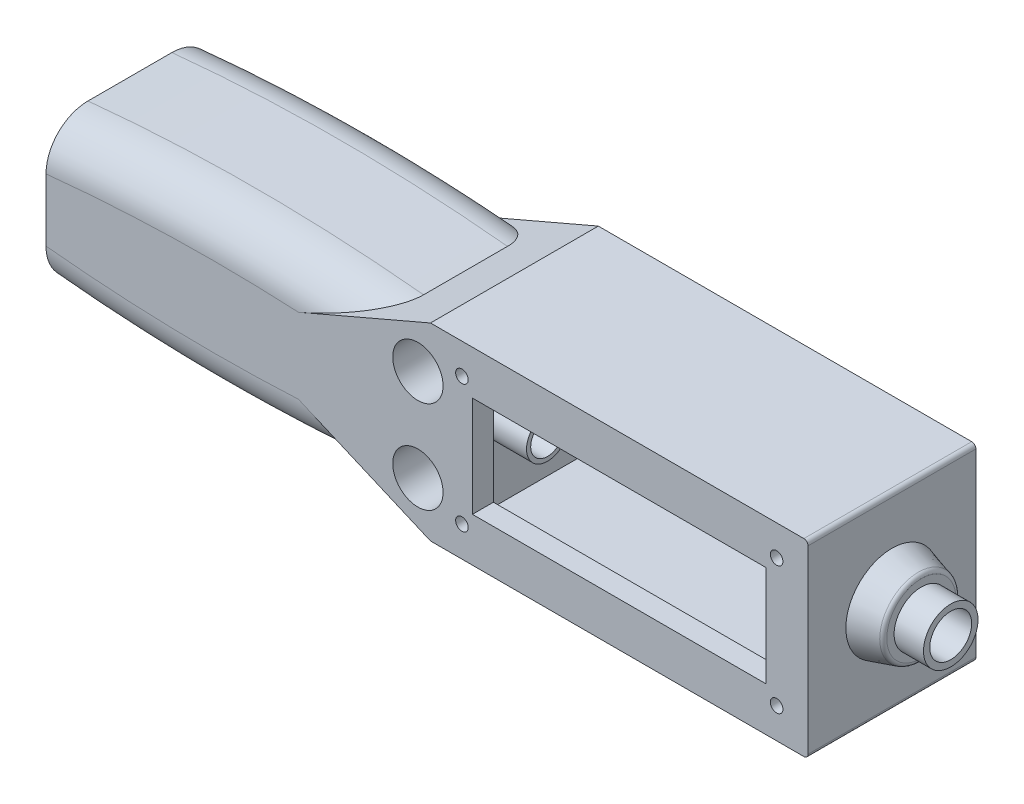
ISO-10303-21;
HEADER;
FILE_DESCRIPTION(('STEP AP214'),'2;1');
FILE_NAME('part.step','',(''),(''),'','','');
FILE_SCHEMA(('AUTOMOTIVE_DESIGN { 1 0 10303 214 1 1 1 1 }'));
ENDSEC;
DATA;
#1=APPLICATION_CONTEXT('core data for automotive mechanical design processes');
#2=APPLICATION_PROTOCOL_DEFINITION('international standard','automotive_design',2000,#1);
#3=PRODUCT_CONTEXT('',#1,'mechanical');
#4=PRODUCT('Part','Part','',(#3));
#5=PRODUCT_RELATED_PRODUCT_CATEGORY('part','',(#4));
#6=PRODUCT_DEFINITION_FORMATION('','',#4);
#7=PRODUCT_DEFINITION_CONTEXT('part definition',#1,'design');
#8=PRODUCT_DEFINITION('design','',#6,#7);
#9=PRODUCT_DEFINITION_SHAPE('','',#8);
#10=(LENGTH_UNIT() NAMED_UNIT(*) SI_UNIT(.MILLI.,.METRE.));
#11=(NAMED_UNIT(*) PLANE_ANGLE_UNIT() SI_UNIT($,.RADIAN.));
#12=(NAMED_UNIT(*) SI_UNIT($,.STERADIAN.) SOLID_ANGLE_UNIT());
#13=UNCERTAINTY_MEASURE_WITH_UNIT(LENGTH_MEASURE(1.E-05),#10,'distance_accuracy_value','');
#14=(GEOMETRIC_REPRESENTATION_CONTEXT(3) GLOBAL_UNCERTAINTY_ASSIGNED_CONTEXT((#13)) GLOBAL_UNIT_ASSIGNED_CONTEXT((#10,
#11,#12)) REPRESENTATION_CONTEXT('',''));
#15=CARTESIAN_POINT('',(0.,0.,0.));
#16=DIRECTION('',(0.,0.,1.));
#17=DIRECTION('',(1.,0.,0.));
#18=AXIS2_PLACEMENT_3D('',#15,#16,#17);
#19=CARTESIAN_POINT('',(30.,0.,15.));
#20=DIRECTION('',(-1.,0.,0.));
#21=DIRECTION('',(0.,0.,1.));
#22=AXIS2_PLACEMENT_3D('',#19,#20,#21);
#23=PLANE('',#22);
#24=CARTESIAN_POINT('',(30.,0.,15.));
#25=DIRECTION('',(-1.,0.,0.));
#26=DIRECTION('',(0.,0.,1.));
#27=AXIS2_PLACEMENT_3D('',#24,#25,#26);
#28=CIRCLE('',#27,5.);
#29=CARTESIAN_POINT('',(30.,0.,20.));
#30=VERTEX_POINT('',#29);
#31=EDGE_CURVE('E11',#30,#30,#28,.T.);
#32=ORIENTED_EDGE('',*,*,#31,.T.);
#33=EDGE_LOOP('',(#32));
#34=FACE_BOUND('',#33,.T.);
#35=CARTESIAN_POINT('',(30.,0.,15.));
#36=DIRECTION('',(-1.,0.,0.));
#37=DIRECTION('',(0.,0.,1.));
#38=AXIS2_PLACEMENT_3D('',#35,#36,#37);
#39=CIRCLE('',#38,4.);
#40=CARTESIAN_POINT('',(30.,0.,19.));
#41=VERTEX_POINT('',#40);
#42=EDGE_CURVE('E61',#41,#41,#39,.T.);
#43=ORIENTED_EDGE('',*,*,#42,.F.);
#44=EDGE_LOOP('',(#43));
#45=FACE_BOUND('',#44,.T.);
#46=ADVANCED_FACE('F50',(#34,#45),#23,.T.);
#47=CARTESIAN_POINT('',(40.,0.,15.));
#48=DIRECTION('',(-1.,0.,0.));
#49=DIRECTION('',(0.,0.,1.));
#50=AXIS2_PLACEMENT_3D('',#47,#48,#49);
#51=PLANE('',#50);
#52=CARTESIAN_POINT('',(40.,0.,15.));
#53=DIRECTION('',(-1.,0.,0.));
#54=DIRECTION('',(0.,0.,1.));
#55=AXIS2_PLACEMENT_3D('',#52,#53,#54);
#56=CIRCLE('',#55,5.);
#57=CARTESIAN_POINT('',(40.,0.,20.));
#58=VERTEX_POINT('',#57);
#59=EDGE_CURVE('E54',#58,#58,#56,.T.);
#60=ORIENTED_EDGE('',*,*,#59,.F.);
#61=EDGE_LOOP('',(#60));
#62=FACE_BOUND('',#61,.T.);
#63=CARTESIAN_POINT('',(40.,0.,15.));
#64=DIRECTION('',(-1.,0.,0.));
#65=DIRECTION('',(0.,0.,1.));
#66=AXIS2_PLACEMENT_3D('',#63,#64,#65);
#67=CIRCLE('',#66,4.);
#68=CARTESIAN_POINT('',(40.,0.,19.));
#69=VERTEX_POINT('',#68);
#70=EDGE_CURVE('E63',#69,#69,#67,.T.);
#71=ORIENTED_EDGE('',*,*,#70,.T.);
#72=EDGE_LOOP('',(#71));
#73=FACE_BOUND('',#72,.T.);
#74=ADVANCED_FACE('F73',(#62,#73),#51,.F.);
#75=CARTESIAN_POINT('',(30.,0.,15.));
#76=DIRECTION('',(1.,0.,0.));
#77=DIRECTION('',(0.,0.,-1.));
#78=AXIS2_PLACEMENT_3D('',#75,#76,#77);
#79=CYLINDRICAL_SURFACE('',#78,5.);
#80=ORIENTED_EDGE('',*,*,#31,.F.);
#81=EDGE_LOOP('',(#80));
#82=FACE_BOUND('',#81,.T.);
#83=ORIENTED_EDGE('',*,*,#59,.T.);
#84=EDGE_LOOP('',(#83));
#85=FACE_BOUND('',#84,.T.);
#86=ADVANCED_FACE('F52',(#82,#85),#79,.T.);
#87=CARTESIAN_POINT('',(30.,0.,15.));
#88=DIRECTION('',(1.,0.,0.));
#89=DIRECTION('',(0.,0.,-1.));
#90=AXIS2_PLACEMENT_3D('',#87,#88,#89);
#91=CYLINDRICAL_SURFACE('',#90,4.);
#92=ORIENTED_EDGE('',*,*,#42,.T.);
#93=EDGE_LOOP('',(#92));
#94=FACE_BOUND('',#93,.T.);
#95=ORIENTED_EDGE('',*,*,#70,.F.);
#96=EDGE_LOOP('',(#95));
#97=FACE_BOUND('',#96,.T.);
#98=ADVANCED_FACE('F69',(#94,#97),#91,.F.);
#99=CLOSED_SHELL('',(#46,#74,#86,#98));
#100=MANIFOLD_SOLID_BREP('B2',#99);
#101=CARTESIAN_POINT('',(-40.,18.,-20.));
#102=DIRECTION('',(-1.,0.,0.));
#103=DIRECTION('',(0.,-1.,0.));
#104=AXIS2_PLACEMENT_3D('',#101,#102,#103);
#105=PLANE('',#104);
#106=CARTESIAN_POINT('',(-40.,0.,7.89));
#107=DIRECTION('',(-1.,0.,0.));
#108=DIRECTION('',(0.,-1.,0.));
#109=AXIS2_PLACEMENT_3D('',#106,#107,#108);
#110=CIRCLE('',#109,5.);
#111=CARTESIAN_POINT('',(-40.,-5.00000000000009,7.89));
#112=VERTEX_POINT('',#111);
#113=EDGE_CURVE('E683',#112,#112,#110,.F.);
#114=ORIENTED_EDGE('',*,*,#113,.F.);
#115=EDGE_LOOP('',(#114));
#116=FACE_BOUND('',#115,.T.);
#117=DIRECTION('',(0.,-1.,0.));
#118=VECTOR('',#117,1.);
#119=CARTESIAN_POINT('',(-40.,18.,2.5));
#120=LINE('',#119,#118);
#121=CARTESIAN_POINT('',(-40.,18.,2.5));
#122=VERTEX_POINT('',#121);
#123=CARTESIAN_POINT('',(-40.,-18.,2.5));
#124=VERTEX_POINT('',#123);
#125=EDGE_CURVE('E408',#122,#124,#120,.T.);
#126=ORIENTED_EDGE('',*,*,#125,.F.);
#127=DIRECTION('',(0.,0.,1.));
#128=VECTOR('',#127,1.);
#129=CARTESIAN_POINT('',(-40.,18.,-20.));
#130=LINE('',#129,#128);
#131=CARTESIAN_POINT('',(-40.,18.,30.));
#132=VERTEX_POINT('',#131);
#133=EDGE_CURVE('E440',#122,#132,#130,.T.);
#134=ORIENTED_EDGE('',*,*,#133,.T.);
#135=DIRECTION('',(0.,-1.,0.));
#136=VECTOR('',#135,1.);
#137=CARTESIAN_POINT('',(-40.,18.,30.));
#138=LINE('',#137,#136);
#139=CARTESIAN_POINT('',(-40.,-18.,30.));
#140=VERTEX_POINT('',#139);
#141=EDGE_CURVE('E427',#132,#140,#138,.T.);
#142=ORIENTED_EDGE('',*,*,#141,.T.);
#143=DIRECTION('',(0.,0.,1.));
#144=VECTOR('',#143,1.);
#145=CARTESIAN_POINT('',(-40.,-18.,-20.));
#146=LINE('',#145,#144);
#147=EDGE_CURVE('E439',#124,#140,#146,.T.);
#148=ORIENTED_EDGE('',*,*,#147,.F.);
#149=EDGE_LOOP('',(#126,#134,#142,#148));
#150=FACE_BOUND('',#149,.T.);
#151=CARTESIAN_POINT('',(-40.,0.,22.11));
#152=DIRECTION('',(-1.,0.,0.));
#153=DIRECTION('',(0.,-1.,0.));
#154=AXIS2_PLACEMENT_3D('',#151,#152,#153);
#155=CIRCLE('',#154,5.);
#156=CARTESIAN_POINT('',(-40.,-5.00000000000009,22.11));
#157=VERTEX_POINT('',#156);
#158=EDGE_CURVE('E694',#157,#157,#155,.F.);
#159=ORIENTED_EDGE('',*,*,#158,.F.);
#160=EDGE_LOOP('',(#159));
#161=FACE_BOUND('',#160,.T.);
#162=ADVANCED_FACE('F111',(#116,#150,#161),#105,.F.);
#163=CARTESIAN_POINT('',(-136.637446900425,17.5,-5.));
#164=DIRECTION('',(-1.,0.,0.));
#165=DIRECTION('',(0.,-1.,0.));
#166=AXIS2_PLACEMENT_3D('',#163,#164,#165);
#167=PLANE('',#166);
#168=DIRECTION('',(0.,0.,1.));
#169=VECTOR('',#168,1.);
#170=CARTESIAN_POINT('',(-136.637446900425,-17.5,-5.));
#171=LINE('',#170,#169);
#172=CARTESIAN_POINT('',(-136.637446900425,-17.5,5.));
#173=VERTEX_POINT('',#172);
#174=CARTESIAN_POINT('',(-136.637446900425,-17.5,25.));
#175=VERTEX_POINT('',#174);
#176=EDGE_CURVE('E474',#173,#175,#171,.T.);
#177=ORIENTED_EDGE('',*,*,#176,.T.);
#178=CARTESIAN_POINT('',(-136.637446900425,-17.5,25.));
#179=CARTESIAN_POINT('',(-136.637446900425,-17.5000311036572,25.2802286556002));
#180=CARTESIAN_POINT('',(-136.637446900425,-17.4881627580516,25.5604524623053));
#181=CARTESIAN_POINT('',(-136.637446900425,-17.4408521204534,26.1188874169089));
#182=CARTESIAN_POINT('',(-136.637446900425,-17.4054111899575,26.3970986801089));
#183=CARTESIAN_POINT('',(-136.637446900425,-17.311222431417,26.9492913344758));
#184=CARTESIAN_POINT('',(-136.637446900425,-17.2524954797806,27.223276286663));
#185=CARTESIAN_POINT('',(-136.637446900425,-17.1121742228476,27.7653227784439));
#186=CARTESIAN_POINT('',(-136.637446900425,-17.0305801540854,28.0333843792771));
#187=CARTESIAN_POINT('',(-136.637446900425,-16.8450776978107,28.5617994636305));
#188=CARTESIAN_POINT('',(-136.637446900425,-16.7411598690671,28.8221496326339));
#189=CARTESIAN_POINT('',(-136.637446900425,-16.5117848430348,29.3331887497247));
#190=CARTESIAN_POINT('',(-136.637446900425,-16.3863271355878,29.5838774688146));
#191=CARTESIAN_POINT('',(-136.637446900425,-16.1148044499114,30.0737845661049));
#192=CARTESIAN_POINT('',(-136.637446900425,-15.9687425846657,30.3130046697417));
#193=CARTESIAN_POINT('',(-136.637446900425,-15.6570529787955,30.7783369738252));
#194=CARTESIAN_POINT('',(-136.637446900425,-15.4914253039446,31.0044492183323));
#195=CARTESIAN_POINT('',(-136.637446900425,-15.1414150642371,31.4424638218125));
#196=CARTESIAN_POINT('',(-136.637446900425,-14.9569926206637,31.654334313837));
#197=CARTESIAN_POINT('',(-136.637446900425,-14.5710171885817,32.0618504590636));
#198=CARTESIAN_POINT('',(-136.637446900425,-14.3694641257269,32.257496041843));
#199=CARTESIAN_POINT('',(-136.637446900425,-13.9506267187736,32.6312427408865));
#200=CARTESIAN_POINT('',(-136.637446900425,-13.7333391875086,32.8093402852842));
#201=CARTESIAN_POINT('',(-136.637446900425,-13.2846192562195,33.1467145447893));
#202=CARTESIAN_POINT('',(-136.637446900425,-13.0531870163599,33.3059914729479));
#203=CARTESIAN_POINT('',(-136.637446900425,-12.5766340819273,33.6053747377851));
#204=CARTESIAN_POINT('',(-136.637446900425,-12.3314512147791,33.7453821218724));
#205=CARTESIAN_POINT('',(-136.637446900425,-11.8302043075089,34.0043201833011));
#206=CARTESIAN_POINT('',(-136.637446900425,-11.5741403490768,34.1232510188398));
#207=CARTESIAN_POINT('',(-136.637446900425,-11.0530346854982,34.3391795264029));
#208=CARTESIAN_POINT('',(-136.637446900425,-10.7879965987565,34.436185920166));
#209=CARTESIAN_POINT('',(-136.637446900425,-10.2508312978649,34.6076399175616));
#210=CARTESIAN_POINT('',(-136.637446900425,-9.97870570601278,34.6820926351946));
#211=CARTESIAN_POINT('',(-136.637446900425,-9.33407880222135,34.8297236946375));
#212=CARTESIAN_POINT('',(-136.637446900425,-8.95937697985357,34.8935769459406));
#213=CARTESIAN_POINT('',(-136.637446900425,-8.39423090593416,34.9574212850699));
#214=CARTESIAN_POINT('',(-136.637446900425,-8.20544086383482,34.9733801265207));
#215=CARTESIAN_POINT('',(-136.637446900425,-7.82722352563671,34.9946694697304));
#216=CARTESIAN_POINT('',(-136.637446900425,-7.63779610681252,34.9999977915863));
#217=CARTESIAN_POINT('',(-136.637446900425,-7.44831998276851,35.));
#218=B_SPLINE_CURVE_WITH_KNOTS('',3,(#178,#179,#180,#181,#182,#183,#184,#185,#186,#187,#188,
#189,#190,#191,#192,#193,#194,#195,#196,#197,#198,#199,#200,#201,#202,#203,#204,#205,#206,#207,
#208,#209,#210,#211,#212,#213,#214,#215,#216,#217),.UNSPECIFIED.,.F.,.F.,(4,2,2,2,2,2,2,2,2,2,2,
2,2,2,2,2,2,2,2,4),(0.,0.840427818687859,1.68080710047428,2.5204346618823,3.36005353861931,
4.20002821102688,5.0400227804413,5.87989057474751,6.71975554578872,7.56144118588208,
8.40313047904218,9.2449907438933,10.086841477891,10.9328656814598,11.7788835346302,
12.6245642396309,13.4700530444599,14.6076157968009,15.1757555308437,15.7440117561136),.UNSPECIFIED.);
#219=CARTESIAN_POINT('',(-136.637446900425,-7.44831998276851,35.));
#220=VERTEX_POINT('',#219);
#221=EDGE_CURVE('E663',#175,#220,#218,.T.);
#222=ORIENTED_EDGE('',*,*,#221,.T.);
#223=DIRECTION('',(0.,-1.,0.));
#224=VECTOR('',#223,1.);
#225=CARTESIAN_POINT('',(-136.637446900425,17.5,35.));
#226=LINE('',#225,#224);
#227=CARTESIAN_POINT('',(-136.637446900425,7.44831998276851,35.));
#228=VERTEX_POINT('',#227);
#229=EDGE_CURVE('E467',#228,#220,#226,.T.);
#230=ORIENTED_EDGE('',*,*,#229,.F.);
#231=CARTESIAN_POINT('',(-136.637446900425,7.44831998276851,35.));
#232=CARTESIAN_POINT('',(-136.637446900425,7.73211686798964,35.0000294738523));
#233=CARTESIAN_POINT('',(-136.637446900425,8.01591008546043,34.988047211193));
#234=CARTESIAN_POINT('',(-136.637446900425,8.58147512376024,34.9402700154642));
#235=CARTESIAN_POINT('',(-136.637446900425,8.86324701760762,34.9044759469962));
#236=CARTESIAN_POINT('',(-136.637446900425,9.42260807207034,34.8093145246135));
#237=CARTESIAN_POINT('',(-136.637446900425,9.70019964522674,34.7499613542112));
#238=CARTESIAN_POINT('',(-136.637446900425,10.2493972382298,34.6080987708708));
#239=CARTESIAN_POINT('',(-136.637446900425,10.5210033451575,34.525589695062));
#240=CARTESIAN_POINT('',(-136.637446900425,11.0564432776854,34.337929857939));
#241=CARTESIAN_POINT('',(-136.637446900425,11.3202728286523,34.2327668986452));
#242=CARTESIAN_POINT('',(-136.637446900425,11.8381229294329,34.0005521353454));
#243=CARTESIAN_POINT('',(-136.637446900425,12.0921432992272,33.8734999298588));
#244=CARTESIAN_POINT('',(-136.637446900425,12.5884890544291,33.5984223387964));
#245=CARTESIAN_POINT('',(-136.637446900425,12.8308170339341,33.4504016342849));
#246=CARTESIAN_POINT('',(-136.637446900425,13.3020885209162,33.1344011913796));
#247=CARTESIAN_POINT('',(-136.637446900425,13.5310321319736,32.9664216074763));
#248=CARTESIAN_POINT('',(-136.637446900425,13.9733291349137,32.6121216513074));
#249=CARTESIAN_POINT('',(-136.637446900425,14.1867196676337,32.4258476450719));
#250=CARTESIAN_POINT('',(-136.637446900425,14.5969849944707,32.0359226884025));
#251=CARTESIAN_POINT('',(-136.637446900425,14.7938598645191,31.832271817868));
#252=CARTESIAN_POINT('',(-136.637446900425,15.1696984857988,31.4089885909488));
#253=CARTESIAN_POINT('',(-136.637446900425,15.3486585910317,31.1893529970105));
#254=CARTESIAN_POINT('',(-136.637446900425,15.6873082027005,30.7357019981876));
#255=CARTESIAN_POINT('',(-136.637446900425,15.8469980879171,30.5016868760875));
#256=CARTESIAN_POINT('',(-136.637446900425,16.1452353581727,30.0220708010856));
#257=CARTESIAN_POINT('',(-136.637446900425,16.283878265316,29.7765292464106));
#258=CARTESIAN_POINT('',(-136.637446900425,16.5398954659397,29.2746061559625));
#259=CARTESIAN_POINT('',(-136.637446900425,16.6572702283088,29.0182248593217));
#260=CARTESIAN_POINT('',(-136.637446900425,16.8698375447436,28.4965705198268));
#261=CARTESIAN_POINT('',(-136.637446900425,16.9650415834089,28.2313021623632));
#262=CARTESIAN_POINT('',(-136.637446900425,17.1326194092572,27.6937607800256));
#263=CARTESIAN_POINT('',(-136.637446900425,17.2049989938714,27.4214895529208));
#264=CARTESIAN_POINT('',(-136.637446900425,17.3435407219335,26.7942293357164));
#265=CARTESIAN_POINT('',(-136.637446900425,17.4022108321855,26.4375401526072));
#266=CARTESIAN_POINT('',(-136.637446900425,17.4608773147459,25.899751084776));
#267=CARTESIAN_POINT('',(-136.637446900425,17.4755430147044,25.7201224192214));
#268=CARTESIAN_POINT('',(-136.637446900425,17.4951033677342,25.3603432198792));
#269=CARTESIAN_POINT('',(-136.637446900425,17.4999985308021,25.1801927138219));
#270=CARTESIAN_POINT('',(-136.637446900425,17.5,25.));
#271=B_SPLINE_CURVE_WITH_KNOTS('',3,(#231,#232,#233,#234,#235,#236,#237,#238,#239,#240,#241,
#242,#243,#244,#245,#246,#247,#248,#249,#250,#251,#252,#253,#254,#255,#256,#257,#258,#259,#260,
#261,#262,#263,#264,#265,#266,#267,#268,#269,#270),.UNSPECIFIED.,.F.,.F.,(4,2,2,2,2,2,2,2,2,2,2,
2,2,2,2,2,2,2,2,4),(0.,0.851132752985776,1.70223460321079,2.55282483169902,3.40340267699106,
4.25443966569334,5.10549226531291,5.95635517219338,6.80721149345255,7.65596444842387,
8.5047135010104,9.35363494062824,10.2025396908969,11.0474684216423,11.8923785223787,
12.7368499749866,13.5811067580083,14.6631350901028,15.2035907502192,15.7440181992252),.UNSPECIFIED.);
#272=CARTESIAN_POINT('',(-136.637446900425,17.5,25.));
#273=VERTEX_POINT('',#272);
#274=EDGE_CURVE('E622',#228,#273,#271,.T.);
#275=ORIENTED_EDGE('',*,*,#274,.T.);
#276=DIRECTION('',(0.,0.,1.));
#277=VECTOR('',#276,1.);
#278=CARTESIAN_POINT('',(-136.637446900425,17.5,-5.));
#279=LINE('',#278,#277);
#280=CARTESIAN_POINT('',(-136.637446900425,17.5,5.));
#281=VERTEX_POINT('',#280);
#282=EDGE_CURVE('E471',#281,#273,#279,.T.);
#283=ORIENTED_EDGE('',*,*,#282,.F.);
#284=CARTESIAN_POINT('',(-136.637446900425,17.5,5.));
#285=CARTESIAN_POINT('',(-136.637446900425,17.5000311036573,4.71977134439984));
#286=CARTESIAN_POINT('',(-136.637446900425,17.4881627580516,4.43954753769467));
#287=CARTESIAN_POINT('',(-136.637446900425,17.4408521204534,3.88111258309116));
#288=CARTESIAN_POINT('',(-136.637446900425,17.4054111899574,3.60290131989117));
#289=CARTESIAN_POINT('',(-136.637446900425,17.3112224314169,3.05070866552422));
#290=CARTESIAN_POINT('',(-136.637446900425,17.2524954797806,2.77672371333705));
#291=CARTESIAN_POINT('',(-136.637446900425,17.1121742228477,2.23467722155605));
#292=CARTESIAN_POINT('',(-136.637446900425,17.0305801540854,1.96661562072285));
#293=CARTESIAN_POINT('',(-136.637446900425,16.8450776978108,1.43820053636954));
#294=CARTESIAN_POINT('',(-136.637446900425,16.7411598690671,1.17785036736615));
#295=CARTESIAN_POINT('',(-136.637446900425,16.5117848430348,0.666811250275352));
#296=CARTESIAN_POINT('',(-136.637446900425,16.3863271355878,0.416122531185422));
#297=CARTESIAN_POINT('',(-136.637446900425,16.1148044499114,-0.0737845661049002));
#298=CARTESIAN_POINT('',(-136.637446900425,15.9687425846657,-0.31300466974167));
#299=CARTESIAN_POINT('',(-136.637446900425,15.6570529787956,-0.7783369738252));
#300=CARTESIAN_POINT('',(-136.637446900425,15.4914253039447,-1.00444921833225));
#301=CARTESIAN_POINT('',(-136.637446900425,15.1414150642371,-1.44246382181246));
#302=CARTESIAN_POINT('',(-136.637446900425,14.9569926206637,-1.65433431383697));
#303=CARTESIAN_POINT('',(-136.637446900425,14.5710171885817,-2.06185045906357));
#304=CARTESIAN_POINT('',(-136.637446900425,14.3694641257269,-2.25749604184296));
#305=CARTESIAN_POINT('',(-136.637446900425,13.9506267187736,-2.63124274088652));
#306=CARTESIAN_POINT('',(-136.637446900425,13.7333391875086,-2.80934028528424));
#307=CARTESIAN_POINT('',(-136.637446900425,13.2846192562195,-3.14671454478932));
#308=CARTESIAN_POINT('',(-136.637446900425,13.0531870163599,-3.3059914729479));
#309=CARTESIAN_POINT('',(-136.637446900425,12.5766340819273,-3.6053747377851));
#310=CARTESIAN_POINT('',(-136.637446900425,12.3314512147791,-3.74538212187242));
#311=CARTESIAN_POINT('',(-136.637446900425,11.8302043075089,-4.0043201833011));
#312=CARTESIAN_POINT('',(-136.637446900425,11.5741403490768,-4.12325101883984));
#313=CARTESIAN_POINT('',(-136.637446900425,11.0530346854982,-4.33917952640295));
#314=CARTESIAN_POINT('',(-136.637446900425,10.7879965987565,-4.43618592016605));
#315=CARTESIAN_POINT('',(-136.637446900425,10.2508312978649,-4.60763991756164));
#316=CARTESIAN_POINT('',(-136.637446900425,9.9787057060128,-4.68209263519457));
#317=CARTESIAN_POINT('',(-136.637446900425,9.33407880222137,-4.82972369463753));
#318=CARTESIAN_POINT('',(-136.637446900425,8.95937697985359,-4.89357694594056));
#319=CARTESIAN_POINT('',(-136.637446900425,8.39423090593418,-4.95742128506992));
#320=CARTESIAN_POINT('',(-136.637446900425,8.20544086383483,-4.97338012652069));
#321=CARTESIAN_POINT('',(-136.637446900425,7.82722352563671,-4.99466946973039));
#322=CARTESIAN_POINT('',(-136.637446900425,7.63779610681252,-4.99999779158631));
#323=CARTESIAN_POINT('',(-136.637446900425,7.44831998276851,-5.));
#324=B_SPLINE_CURVE_WITH_KNOTS('',3,(#284,#285,#286,#287,#288,#289,#290,#291,#292,#293,#294,
#295,#296,#297,#298,#299,#300,#301,#302,#303,#304,#305,#306,#307,#308,#309,#310,#311,#312,#313,
#314,#315,#316,#317,#318,#319,#320,#321,#322,#323),.UNSPECIFIED.,.F.,.F.,(4,2,2,2,2,2,2,2,2,2,2,
2,2,2,2,2,2,2,2,4),(0.,0.840427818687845,1.68080710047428,2.5204346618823,3.36005353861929,
4.20002821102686,5.04002278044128,5.87989057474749,6.7197555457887,7.56144118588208,
8.40313047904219,9.24499074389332,10.086841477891,10.9328656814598,11.7788835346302,
12.6245642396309,13.4700530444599,14.6076157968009,15.1757555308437,15.7440117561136),.UNSPECIFIED.);
#325=CARTESIAN_POINT('',(-136.637446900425,7.44831998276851,-5.));
#326=VERTEX_POINT('',#325);
#327=EDGE_CURVE('E550',#281,#326,#324,.T.);
#328=ORIENTED_EDGE('',*,*,#327,.T.);
#329=DIRECTION('',(0.,-1.,0.));
#330=VECTOR('',#329,1.);
#331=CARTESIAN_POINT('',(-136.637446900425,17.5,-5.));
#332=LINE('',#331,#330);
#333=CARTESIAN_POINT('',(-136.637446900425,-7.44831998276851,-5.));
#334=VERTEX_POINT('',#333);
#335=EDGE_CURVE('E468',#326,#334,#332,.T.);
#336=ORIENTED_EDGE('',*,*,#335,.T.);
#337=CARTESIAN_POINT('',(-136.637446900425,-7.44831998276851,-5.));
#338=CARTESIAN_POINT('',(-136.637446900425,-7.73211686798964,-5.00002947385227));
#339=CARTESIAN_POINT('',(-136.637446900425,-8.01591008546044,-4.98804721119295));
#340=CARTESIAN_POINT('',(-136.637446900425,-8.58147512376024,-4.94027001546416));
#341=CARTESIAN_POINT('',(-136.637446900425,-8.86324701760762,-4.90447594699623));
#342=CARTESIAN_POINT('',(-136.637446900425,-9.42260807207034,-4.80931452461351));
#343=CARTESIAN_POINT('',(-136.637446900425,-9.70019964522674,-4.74996135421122));
#344=CARTESIAN_POINT('',(-136.637446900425,-10.2493972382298,-4.60809877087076));
#345=CARTESIAN_POINT('',(-136.637446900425,-10.5210033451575,-4.52558969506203));
#346=CARTESIAN_POINT('',(-136.637446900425,-11.0564432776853,-4.33792985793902));
#347=CARTESIAN_POINT('',(-136.637446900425,-11.3202728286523,-4.23276689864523));
#348=CARTESIAN_POINT('',(-136.637446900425,-11.8381229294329,-4.00055213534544));
#349=CARTESIAN_POINT('',(-136.637446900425,-12.0921432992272,-3.87349992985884));
#350=CARTESIAN_POINT('',(-136.637446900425,-12.5884890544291,-3.59842233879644));
#351=CARTESIAN_POINT('',(-136.637446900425,-12.8308170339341,-3.45040163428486));
#352=CARTESIAN_POINT('',(-136.637446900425,-13.3020885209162,-3.13440119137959));
#353=CARTESIAN_POINT('',(-136.637446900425,-13.5310321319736,-2.96642160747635));
#354=CARTESIAN_POINT('',(-136.637446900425,-13.9733291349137,-2.61212165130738));
#355=CARTESIAN_POINT('',(-136.637446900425,-14.1867196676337,-2.42584764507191));
#356=CARTESIAN_POINT('',(-136.637446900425,-14.5969849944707,-2.03592268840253));
#357=CARTESIAN_POINT('',(-136.637446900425,-14.7938598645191,-1.83227181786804));
#358=CARTESIAN_POINT('',(-136.637446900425,-15.1696984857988,-1.40898859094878));
#359=CARTESIAN_POINT('',(-136.637446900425,-15.3486585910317,-1.18935299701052));
#360=CARTESIAN_POINT('',(-136.637446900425,-15.6873082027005,-0.73570199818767));
#361=CARTESIAN_POINT('',(-136.637446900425,-15.8469980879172,-0.501686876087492));
#362=CARTESIAN_POINT('',(-136.637446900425,-16.1452353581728,-0.022070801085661));
#363=CARTESIAN_POINT('',(-136.637446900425,-16.283878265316,0.223470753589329));
#364=CARTESIAN_POINT('',(-136.637446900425,-16.5398954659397,0.72539384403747));
#365=CARTESIAN_POINT('',(-136.637446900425,-16.6572702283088,0.981775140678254));
#366=CARTESIAN_POINT('',(-136.637446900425,-16.8698375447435,1.50342948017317));
#367=CARTESIAN_POINT('',(-136.637446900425,-16.9650415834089,1.76869783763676));
#368=CARTESIAN_POINT('',(-136.637446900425,-17.1326194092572,2.3062392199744));
#369=CARTESIAN_POINT('',(-136.637446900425,-17.2049989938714,2.57851044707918));
#370=CARTESIAN_POINT('',(-136.637446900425,-17.3435407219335,3.20577066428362));
#371=CARTESIAN_POINT('',(-136.637446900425,-17.4022108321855,3.56245984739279));
#372=CARTESIAN_POINT('',(-136.637446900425,-17.4608773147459,4.10024891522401));
#373=CARTESIAN_POINT('',(-136.637446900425,-17.4755430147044,4.27987758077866));
#374=CARTESIAN_POINT('',(-136.637446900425,-17.4951033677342,4.63965678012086));
#375=CARTESIAN_POINT('',(-136.637446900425,-17.4999985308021,4.8198072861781));
#376=CARTESIAN_POINT('',(-136.637446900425,-17.5,5.00000000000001));
#377=B_SPLINE_CURVE_WITH_KNOTS('',3,(#337,#338,#339,#340,#341,#342,#343,#344,#345,#346,#347,
#348,#349,#350,#351,#352,#353,#354,#355,#356,#357,#358,#359,#360,#361,#362,#363,#364,#365,#366,
#367,#368,#369,#370,#371,#372,#373,#374,#375,#376),.UNSPECIFIED.,.F.,.F.,(4,2,2,2,2,2,2,2,2,2,2,
2,2,2,2,2,2,2,2,4),(0.,0.85113275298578,1.70223460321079,2.55282483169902,3.40340267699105,
4.25443966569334,5.1054922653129,5.95635517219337,6.80721149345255,7.65596444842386,
8.5047135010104,9.35363494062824,10.2025396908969,11.0474684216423,11.8923785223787,
12.7368499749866,13.5811067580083,14.6631350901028,15.2035907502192,15.7440181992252),.UNSPECIFIED.);
#378=EDGE_CURVE('E638',#334,#173,#377,.T.);
#379=ORIENTED_EDGE('',*,*,#378,.T.);
#380=EDGE_LOOP('',(#177,#222,#230,#275,#283,#328,#336,#379));
#381=FACE_BOUND('',#380,.T.);
#382=DIRECTION('',(0.,-1.,0.));
#383=VECTOR('',#382,1.);
#384=CARTESIAN_POINT('',(-136.637446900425,0.,0.));
#385=LINE('',#384,#383);
#386=CARTESIAN_POINT('',(-136.637446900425,5.49999999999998,0.));
#387=VERTEX_POINT('',#386);
#388=CARTESIAN_POINT('',(-136.637446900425,-5.5,0.));
#389=VERTEX_POINT('',#388);
#390=EDGE_CURVE('E361',#387,#389,#385,.T.);
#391=ORIENTED_EDGE('',*,*,#390,.F.);
#392=CARTESIAN_POINT('',(-136.637446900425,5.49999999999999,2.));
#393=DIRECTION('',(-1.,0.,0.));
#394=DIRECTION('',(0.,-1.,0.));
#395=AXIS2_PLACEMENT_3D('',#392,#393,#394);
#396=CIRCLE('',#395,2.);
#397=CARTESIAN_POINT('',(-136.637446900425,7.49999999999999,2.00000000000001));
#398=VERTEX_POINT('',#397);
#399=EDGE_CURVE('E319',#387,#398,#396,.F.);
#400=ORIENTED_EDGE('',*,*,#399,.T.);
#401=DIRECTION('',(0.,0.,1.));
#402=VECTOR('',#401,1.);
#403=CARTESIAN_POINT('',(-136.637446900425,7.49999999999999,0.));
#404=LINE('',#403,#402);
#405=CARTESIAN_POINT('',(-136.637446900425,7.49999999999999,28.));
#406=VERTEX_POINT('',#405);
#407=EDGE_CURVE('E379',#398,#406,#404,.T.);
#408=ORIENTED_EDGE('',*,*,#407,.T.);
#409=CARTESIAN_POINT('',(-136.637446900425,5.49999999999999,28.));
#410=DIRECTION('',(-1.,0.,0.));
#411=DIRECTION('',(0.,-1.,0.));
#412=AXIS2_PLACEMENT_3D('',#409,#410,#411);
#413=CIRCLE('',#412,2.);
#414=CARTESIAN_POINT('',(-136.637446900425,5.49999999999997,30.));
#415=VERTEX_POINT('',#414);
#416=EDGE_CURVE('E376',#406,#415,#413,.F.);
#417=ORIENTED_EDGE('',*,*,#416,.T.);
#418=DIRECTION('',(0.,-1.,0.));
#419=VECTOR('',#418,1.);
#420=CARTESIAN_POINT('',(-136.637446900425,0.,30.));
#421=LINE('',#420,#419);
#422=CARTESIAN_POINT('',(-136.637446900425,-5.5,30.));
#423=VERTEX_POINT('',#422);
#424=EDGE_CURVE('E373',#415,#423,#421,.T.);
#425=ORIENTED_EDGE('',*,*,#424,.T.);
#426=CARTESIAN_POINT('',(-136.637446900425,-5.50000000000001,28.));
#427=DIRECTION('',(-1.,0.,0.));
#428=DIRECTION('',(0.,-1.,0.));
#429=AXIS2_PLACEMENT_3D('',#426,#427,#428);
#430=CIRCLE('',#429,2.);
#431=CARTESIAN_POINT('',(-136.637446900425,-7.50000000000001,28.));
#432=VERTEX_POINT('',#431);
#433=EDGE_CURVE('E370',#432,#423,#430,.T.);
#434=ORIENTED_EDGE('',*,*,#433,.F.);
#435=DIRECTION('',(0.,0.,1.));
#436=VECTOR('',#435,1.);
#437=CARTESIAN_POINT('',(-136.637446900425,-7.50000000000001,0.));
#438=LINE('',#437,#436);
#439=CARTESIAN_POINT('',(-136.637446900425,-7.50000000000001,2.00000000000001));
#440=VERTEX_POINT('',#439);
#441=EDGE_CURVE('E367',#440,#432,#438,.T.);
#442=ORIENTED_EDGE('',*,*,#441,.F.);
#443=CARTESIAN_POINT('',(-136.637446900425,-5.50000000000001,2.));
#444=DIRECTION('',(-1.,0.,0.));
#445=DIRECTION('',(0.,-1.,0.));
#446=AXIS2_PLACEMENT_3D('',#443,#444,#445);
#447=CIRCLE('',#446,2.);
#448=EDGE_CURVE('E364',#389,#440,#447,.T.);
#449=ORIENTED_EDGE('',*,*,#448,.F.);
#450=EDGE_LOOP('',(#391,#400,#408,#417,#425,#434,#442,#449));
#451=FACE_BOUND('',#450,.T.);
#452=ADVANCED_FACE('F721',(#381,#451),#167,.T.);
#453=CARTESIAN_POINT('',(40.,18.,-20.));
#454=DIRECTION('',(0.,1.,0.));
#455=DIRECTION('',(-1.,0.,0.));
#456=AXIS2_PLACEMENT_3D('',#453,#454,#455);
#457=PLANE('',#456);
#458=DIRECTION('',(-1.,0.,0.));
#459=VECTOR('',#458,1.);
#460=CARTESIAN_POINT('',(40.,18.,2.5));
#461=LINE('',#460,#459);
#462=CARTESIAN_POINT('',(40.,18.,2.5));
#463=VERTEX_POINT('',#462);
#464=EDGE_CURVE('E424',#463,#122,#461,.T.);
#465=ORIENTED_EDGE('',*,*,#464,.F.);
#466=DIRECTION('',(0.,0.,1.));
#467=VECTOR('',#466,1.);
#468=CARTESIAN_POINT('',(40.,18.,-20.));
#469=LINE('',#468,#467);
#470=CARTESIAN_POINT('',(40.,18.,30.));
#471=VERTEX_POINT('',#470);
#472=EDGE_CURVE('E443',#463,#471,#469,.T.);
#473=ORIENTED_EDGE('',*,*,#472,.T.);
#474=DIRECTION('',(-1.,0.,0.));
#475=VECTOR('',#474,1.);
#476=CARTESIAN_POINT('',(40.,18.,30.));
#477=LINE('',#476,#475);
#478=EDGE_CURVE('E436',#471,#132,#477,.T.);
#479=ORIENTED_EDGE('',*,*,#478,.T.);
#480=ORIENTED_EDGE('',*,*,#133,.F.);
#481=EDGE_LOOP('',(#465,#473,#479,#480));
#482=FACE_BOUND('',#481,.T.);
#483=ADVANCED_FACE('F737',(#482),#457,.F.);
#484=CARTESIAN_POINT('',(40.,18.,-20.));
#485=DIRECTION('',(1.,0.,0.));
#486=DIRECTION('',(0.,0.,-1.));
#487=AXIS2_PLACEMENT_3D('',#484,#485,#486);
#488=PLANE('',#487);
#489=CARTESIAN_POINT('',(40.,0.,15.));
#490=DIRECTION('',(1.,0.,0.));
#491=DIRECTION('',(0.,0.,-1.));
#492=AXIS2_PLACEMENT_3D('',#489,#490,#491);
#493=CIRCLE('',#492,5.);
#494=CARTESIAN_POINT('',(40.,0.,10.));
#495=VERTEX_POINT('',#494);
#496=EDGE_CURVE('E389',#495,#495,#493,.T.);
#497=ORIENTED_EDGE('',*,*,#496,.T.);
#498=EDGE_LOOP('',(#497));
#499=FACE_BOUND('',#498,.T.);
#500=DIRECTION('',(0.,1.,0.));
#501=VECTOR('',#500,1.);
#502=CARTESIAN_POINT('',(40.,18.,2.5));
#503=LINE('',#502,#501);
#504=CARTESIAN_POINT('',(40.,-18.,2.5));
#505=VERTEX_POINT('',#504);
#506=EDGE_CURVE('E421',#505,#463,#503,.T.);
#507=ORIENTED_EDGE('',*,*,#506,.F.);
#508=DIRECTION('',(0.,0.,1.));
#509=VECTOR('',#508,1.);
#510=CARTESIAN_POINT('',(40.,-18.,-20.));
#511=LINE('',#510,#509);
#512=CARTESIAN_POINT('',(40.,-18.,30.));
#513=VERTEX_POINT('',#512);
#514=EDGE_CURVE('E445',#505,#513,#511,.T.);
#515=ORIENTED_EDGE('',*,*,#514,.T.);
#516=DIRECTION('',(0.,1.,0.));
#517=VECTOR('',#516,1.);
#518=CARTESIAN_POINT('',(40.,18.,30.));
#519=LINE('',#518,#517);
#520=EDGE_CURVE('E433',#513,#471,#519,.T.);
#521=ORIENTED_EDGE('',*,*,#520,.T.);
#522=ORIENTED_EDGE('',*,*,#472,.F.);
#523=EDGE_LOOP('',(#507,#515,#521,#522));
#524=FACE_BOUND('',#523,.T.);
#525=ADVANCED_FACE('F823',(#499,#524),#488,.F.);
#526=CARTESIAN_POINT('',(40.,-18.,-20.));
#527=DIRECTION('',(0.,-1.,0.));
#528=DIRECTION('',(1.,0.,0.));
#529=AXIS2_PLACEMENT_3D('',#526,#527,#528);
#530=PLANE('',#529);
#531=DIRECTION('',(1.,0.,0.));
#532=VECTOR('',#531,1.);
#533=CARTESIAN_POINT('',(40.,-18.,2.5));
#534=LINE('',#533,#532);
#535=EDGE_CURVE('E418',#124,#505,#534,.T.);
#536=ORIENTED_EDGE('',*,*,#535,.F.);
#537=ORIENTED_EDGE('',*,*,#147,.T.);
#538=DIRECTION('',(1.,0.,0.));
#539=VECTOR('',#538,1.);
#540=CARTESIAN_POINT('',(40.,-18.,30.));
#541=LINE('',#540,#539);
#542=EDGE_CURVE('E430',#140,#513,#541,.T.);
#543=ORIENTED_EDGE('',*,*,#542,.T.);
#544=ORIENTED_EDGE('',*,*,#514,.F.);
#545=EDGE_LOOP('',(#536,#537,#543,#544));
#546=FACE_BOUND('',#545,.T.);
#547=ADVANCED_FACE('F742',(#546),#530,.F.);
#548=CARTESIAN_POINT('',(0.,12.,35.));
#549=DIRECTION('',(0.,1.,0.));
#550=DIRECTION('',(0.,0.,1.));
#551=AXIS2_PLACEMENT_3D('',#548,#549,#550);
#552=PLANE('',#551);
#553=DIRECTION('',(-1.,0.,0.));
#554=VECTOR('',#553,1.);
#555=CARTESIAN_POINT('',(0.,12.,30.));
#556=LINE('',#555,#554);
#557=CARTESIAN_POINT('',(35.,12.,30.));
#558=VERTEX_POINT('',#557);
#559=CARTESIAN_POINT('',(-35.,12.,30.));
#560=VERTEX_POINT('',#559);
#561=EDGE_CURVE('E465',#558,#560,#556,.T.);
#562=ORIENTED_EDGE('',*,*,#561,.F.);
#563=DIRECTION('',(0.,0.,-1.));
#564=VECTOR('',#563,1.);
#565=CARTESIAN_POINT('',(35.,12.,35.));
#566=LINE('',#565,#564);
#567=CARTESIAN_POINT('',(35.,12.,35.));
#568=VERTEX_POINT('',#567);
#569=EDGE_CURVE('E537',#568,#558,#566,.T.);
#570=ORIENTED_EDGE('',*,*,#569,.F.);
#571=DIRECTION('',(1.,0.,0.));
#572=VECTOR('',#571,1.);
#573=CARTESIAN_POINT('',(0.,12.,35.));
#574=LINE('',#573,#572);
#575=CARTESIAN_POINT('',(-35.,12.,35.));
#576=VERTEX_POINT('',#575);
#577=EDGE_CURVE('E512',#576,#568,#574,.T.);
#578=ORIENTED_EDGE('',*,*,#577,.F.);
#579=DIRECTION('',(0.,0.,-1.));
#580=VECTOR('',#579,1.);
#581=CARTESIAN_POINT('',(-35.,12.,35.));
#582=LINE('',#581,#580);
#583=EDGE_CURVE('E527',#576,#560,#582,.T.);
#584=ORIENTED_EDGE('',*,*,#583,.T.);
#585=EDGE_LOOP('',(#562,#570,#578,#584));
#586=FACE_BOUND('',#585,.T.);
#587=ADVANCED_FACE('F774',(#586),#552,.F.);
#588=CARTESIAN_POINT('',(35.,0.,35.));
#589=DIRECTION('',(1.,0.,0.));
#590=DIRECTION('',(0.,0.,-1.));
#591=AXIS2_PLACEMENT_3D('',#588,#589,#590);
#592=PLANE('',#591);
#593=DIRECTION('',(0.,1.,0.));
#594=VECTOR('',#593,1.);
#595=CARTESIAN_POINT('',(35.,0.,30.));
#596=LINE('',#595,#594);
#597=CARTESIAN_POINT('',(35.,-12.,30.));
#598=VERTEX_POINT('',#597);
#599=EDGE_CURVE('E463',#598,#558,#596,.T.);
#600=ORIENTED_EDGE('',*,*,#599,.F.);
#601=DIRECTION('',(0.,0.,-1.));
#602=VECTOR('',#601,1.);
#603=CARTESIAN_POINT('',(35.,-12.,35.));
#604=LINE('',#603,#602);
#605=CARTESIAN_POINT('',(35.,-12.,35.));
#606=VERTEX_POINT('',#605);
#607=EDGE_CURVE('E534',#606,#598,#604,.T.);
#608=ORIENTED_EDGE('',*,*,#607,.F.);
#609=DIRECTION('',(0.,-1.,0.));
#610=VECTOR('',#609,1.);
#611=CARTESIAN_POINT('',(35.,0.,35.));
#612=LINE('',#611,#610);
#613=EDGE_CURVE('E515',#568,#606,#612,.T.);
#614=ORIENTED_EDGE('',*,*,#613,.F.);
#615=ORIENTED_EDGE('',*,*,#569,.T.);
#616=EDGE_LOOP('',(#600,#608,#614,#615));
#617=FACE_BOUND('',#616,.T.);
#618=ADVANCED_FACE('F770',(#617),#592,.F.);
#619=CARTESIAN_POINT('',(0.,-12.,35.));
#620=DIRECTION('',(0.,1.,0.));
#621=DIRECTION('',(0.,0.,1.));
#622=AXIS2_PLACEMENT_3D('',#619,#620,#621);
#623=PLANE('',#622);
#624=ORIENTED_EDGE('',*,*,#607,.T.);
#625=DIRECTION('',(-1.,0.,0.));
#626=VECTOR('',#625,1.);
#627=CARTESIAN_POINT('',(0.,-12.,30.));
#628=LINE('',#627,#626);
#629=CARTESIAN_POINT('',(-35.,-12.,30.));
#630=VERTEX_POINT('',#629);
#631=EDGE_CURVE('E460',#598,#630,#628,.T.);
#632=ORIENTED_EDGE('',*,*,#631,.T.);
#633=DIRECTION('',(0.,0.,-1.));
#634=VECTOR('',#633,1.);
#635=CARTESIAN_POINT('',(-35.,-12.,35.));
#636=LINE('',#635,#634);
#637=CARTESIAN_POINT('',(-35.,-12.,35.));
#638=VERTEX_POINT('',#637);
#639=EDGE_CURVE('E530',#638,#630,#636,.T.);
#640=ORIENTED_EDGE('',*,*,#639,.F.);
#641=DIRECTION('',(1.,0.,0.));
#642=VECTOR('',#641,1.);
#643=CARTESIAN_POINT('',(0.,-12.,35.));
#644=LINE('',#643,#642);
#645=EDGE_CURVE('E517',#638,#606,#644,.T.);
#646=ORIENTED_EDGE('',*,*,#645,.T.);
#647=EDGE_LOOP('',(#624,#632,#640,#646));
#648=FACE_BOUND('',#647,.T.);
#649=ADVANCED_FACE('F766',(#648),#623,.T.);
#650=CARTESIAN_POINT('',(-35.,0.,35.));
#651=DIRECTION('',(1.,0.,0.));
#652=DIRECTION('',(0.,1.,0.));
#653=AXIS2_PLACEMENT_3D('',#650,#651,#652);
#654=PLANE('',#653);
#655=ORIENTED_EDGE('',*,*,#639,.T.);
#656=DIRECTION('',(0.,1.,0.));
#657=VECTOR('',#656,1.);
#658=CARTESIAN_POINT('',(-35.,0.,30.));
#659=LINE('',#658,#657);
#660=EDGE_CURVE('E457',#630,#560,#659,.T.);
#661=ORIENTED_EDGE('',*,*,#660,.T.);
#662=ORIENTED_EDGE('',*,*,#583,.F.);
#663=DIRECTION('',(0.,-1.,0.));
#664=VECTOR('',#663,1.);
#665=CARTESIAN_POINT('',(-35.,0.,35.));
#666=LINE('',#665,#664);
#667=EDGE_CURVE('E520',#576,#638,#666,.T.);
#668=ORIENTED_EDGE('',*,*,#667,.T.);
#669=EDGE_LOOP('',(#655,#661,#662,#668));
#670=FACE_BOUND('',#669,.T.);
#671=ADVANCED_FACE('F762',(#670),#654,.T.);
#672=CARTESIAN_POINT('',(-37.5,15.25,35.));
#673=DIRECTION('',(0.,0.,-1.));
#674=DIRECTION('',(-1.,0.,0.));
#675=AXIS2_PLACEMENT_3D('',#672,#673,#674);
#676=CYLINDRICAL_SURFACE('',#675,1.5);
#677=CARTESIAN_POINT('',(-37.5,15.25,35.));
#678=DIRECTION('',(0.,0.,1.));
#679=DIRECTION('',(1.,0.,0.));
#680=AXIS2_PLACEMENT_3D('',#677,#678,#679);
#681=CIRCLE('',#680,1.5);
#682=CARTESIAN_POINT('',(-36.,15.25,35.));
#683=VERTEX_POINT('',#682);
#684=EDGE_CURVE('E509',#683,#683,#681,.T.);
#685=ORIENTED_EDGE('',*,*,#684,.T.);
#686=EDGE_LOOP('',(#685));
#687=FACE_BOUND('',#686,.T.);
#688=CARTESIAN_POINT('',(-37.5,15.25,30.));
#689=DIRECTION('',(0.,0.,-1.));
#690=DIRECTION('',(-1.,0.,0.));
#691=AXIS2_PLACEMENT_3D('',#688,#689,#690);
#692=CIRCLE('',#691,1.5);
#693=CARTESIAN_POINT('',(-39.,15.25,30.));
#694=VERTEX_POINT('',#693);
#695=EDGE_CURVE('E454',#694,#694,#692,.T.);
#696=ORIENTED_EDGE('',*,*,#695,.T.);
#697=EDGE_LOOP('',(#696));
#698=FACE_BOUND('',#697,.T.);
#699=ADVANCED_FACE('F765',(#687,#698),#676,.F.);
#700=CARTESIAN_POINT('',(37.5,15.25,35.));
#701=DIRECTION('',(0.,0.,-1.));
#702=DIRECTION('',(-1.,0.,0.));
#703=AXIS2_PLACEMENT_3D('',#700,#701,#702);
#704=CYLINDRICAL_SURFACE('',#703,1.5);
#705=CARTESIAN_POINT('',(37.5,15.25,35.));
#706=DIRECTION('',(0.,0.,1.));
#707=DIRECTION('',(1.,0.,0.));
#708=AXIS2_PLACEMENT_3D('',#705,#706,#707);
#709=CIRCLE('',#708,1.5);
#710=CARTESIAN_POINT('',(39.,15.25,35.));
#711=VERTEX_POINT('',#710);
#712=EDGE_CURVE('E506',#711,#711,#709,.F.);
#713=ORIENTED_EDGE('',*,*,#712,.F.);
#714=EDGE_LOOP('',(#713));
#715=FACE_BOUND('',#714,.T.);
#716=CARTESIAN_POINT('',(37.5,15.25,30.));
#717=DIRECTION('',(0.,0.,-1.));
#718=DIRECTION('',(-1.,0.,0.));
#719=AXIS2_PLACEMENT_3D('',#716,#717,#718);
#720=CIRCLE('',#719,1.5);
#721=CARTESIAN_POINT('',(36.,15.25,30.));
#722=VERTEX_POINT('',#721);
#723=EDGE_CURVE('E451',#722,#722,#720,.F.);
#724=ORIENTED_EDGE('',*,*,#723,.F.);
#725=EDGE_LOOP('',(#724));
#726=FACE_BOUND('',#725,.T.);
#727=ADVANCED_FACE('F780',(#715,#726),#704,.F.);
#728=CARTESIAN_POINT('',(37.4999999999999,-15.25,35.));
#729=DIRECTION('',(0.,0.,-1.));
#730=DIRECTION('',(-1.,0.,0.));
#731=AXIS2_PLACEMENT_3D('',#728,#729,#730);
#732=CYLINDRICAL_SURFACE('',#731,1.5);
#733=CARTESIAN_POINT('',(37.4999999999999,-15.25,35.));
#734=DIRECTION('',(0.,0.,1.));
#735=DIRECTION('',(1.,0.,0.));
#736=AXIS2_PLACEMENT_3D('',#733,#734,#735);
#737=CIRCLE('',#736,1.5);
#738=CARTESIAN_POINT('',(38.9999999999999,-15.25,35.));
#739=VERTEX_POINT('',#738);
#740=EDGE_CURVE('E503',#739,#739,#737,.T.);
#741=ORIENTED_EDGE('',*,*,#740,.T.);
#742=EDGE_LOOP('',(#741));
#743=FACE_BOUND('',#742,.T.);
#744=CARTESIAN_POINT('',(37.4999999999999,-15.25,30.));
#745=DIRECTION('',(0.,0.,-1.));
#746=DIRECTION('',(-1.,0.,0.));
#747=AXIS2_PLACEMENT_3D('',#744,#745,#746);
#748=CIRCLE('',#747,1.5);
#749=CARTESIAN_POINT('',(35.9999999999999,-15.25,30.));
#750=VERTEX_POINT('',#749);
#751=EDGE_CURVE('E448',#750,#750,#748,.T.);
#752=ORIENTED_EDGE('',*,*,#751,.T.);
#753=EDGE_LOOP('',(#752));
#754=FACE_BOUND('',#753,.T.);
#755=ADVANCED_FACE('F596',(#743,#754),#732,.F.);
#756=CARTESIAN_POINT('',(-37.5,-15.25,35.));
#757=DIRECTION('',(0.,0.,-1.));
#758=DIRECTION('',(-1.,0.,0.));
#759=AXIS2_PLACEMENT_3D('',#756,#757,#758);
#760=CYLINDRICAL_SURFACE('',#759,1.5);
#761=CARTESIAN_POINT('',(-37.5,-15.25,35.));
#762=DIRECTION('',(0.,0.,1.));
#763=DIRECTION('',(1.,0.,0.));
#764=AXIS2_PLACEMENT_3D('',#761,#762,#763);
#765=CIRCLE('',#764,1.5);
#766=CARTESIAN_POINT('',(-36.,-15.25,35.));
#767=VERTEX_POINT('',#766);
#768=EDGE_CURVE('E523',#767,#767,#765,.F.);
#769=ORIENTED_EDGE('',*,*,#768,.F.);
#770=EDGE_LOOP('',(#769));
#771=FACE_BOUND('',#770,.T.);
#772=CARTESIAN_POINT('',(-37.5,-15.25,30.));
#773=DIRECTION('',(0.,0.,-1.));
#774=DIRECTION('',(-1.,0.,0.));
#775=AXIS2_PLACEMENT_3D('',#772,#773,#774);
#776=CIRCLE('',#775,1.5);
#777=CARTESIAN_POINT('',(-39.,-15.25,30.));
#778=VERTEX_POINT('',#777);
#779=EDGE_CURVE('E442',#778,#778,#776,.F.);
#780=ORIENTED_EDGE('',*,*,#779,.F.);
#781=EDGE_LOOP('',(#780));
#782=FACE_BOUND('',#781,.T.);
#783=ADVANCED_FACE('F758',(#771,#782),#760,.F.);
#784=CARTESIAN_POINT('',(-15.1730361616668,-35.3150805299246,35.));
#785=DIRECTION('',(-0.394754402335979,-0.918786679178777,0.));
#786=DIRECTION('',(0.918786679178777,-0.394754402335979,0.));
#787=AXIS2_PLACEMENT_3D('',#784,#785,#786);
#788=PLANE('',#787);
#789=DIRECTION('',(-0.918786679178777,0.394754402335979,0.));
#790=VECTOR('',#789,1.);
#791=CARTESIAN_POINT('',(-15.1730361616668,-35.3150805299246,35.));
#792=LINE('',#791,#790);
#793=CARTESIAN_POINT('',(-45.,-22.5,35.));
#794=VERTEX_POINT('',#793);
#795=CARTESIAN_POINT('',(-76.4611940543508,-8.98277653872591,35.));
#796=VERTEX_POINT('',#795);
#797=EDGE_CURVE('E492',#794,#796,#792,.T.);
#798=ORIENTED_EDGE('',*,*,#797,.T.);
#799=CARTESIAN_POINT('',(-76.4611940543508,-8.98277653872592,35.));
#800=CARTESIAN_POINT('',(-76.1814776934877,-9.10295597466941,34.9999971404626));
#801=CARTESIAN_POINT('',(-75.9017667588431,-9.22313307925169,34.9972872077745));
#802=CARTESIAN_POINT('',(-75.3424305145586,-9.46345049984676,34.9863600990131));
#803=CARTESIAN_POINT('',(-75.0628052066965,-9.58359081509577,34.9781428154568));
#804=CARTESIAN_POINT('',(-74.2240381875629,-9.94396497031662,34.9450846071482));
#805=CARTESIAN_POINT('',(-73.6651536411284,-10.1840883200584,34.9118372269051));
#806=CARTESIAN_POINT('',(-72.5440452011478,-10.6657697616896,34.8214813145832));
#807=CARTESIAN_POINT('',(-71.9818354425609,-10.9073217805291,34.7641645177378));
#808=CARTESIAN_POINT('',(-70.8601245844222,-11.3892620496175,34.624159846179));
#809=CARTESIAN_POINT('',(-70.3006232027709,-11.6296504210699,34.5414746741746));
#810=CARTESIAN_POINT('',(-69.175846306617,-12.1129080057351,34.3470539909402));
#811=CARTESIAN_POINT('',(-68.6106403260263,-12.3557473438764,34.2348368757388));
#812=CARTESIAN_POINT('',(-67.4860280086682,-12.8389342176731,33.9792668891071));
#813=CARTESIAN_POINT('',(-66.9266230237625,-13.0792811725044,33.8359069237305));
#814=CARTESIAN_POINT('',(-65.8182044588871,-13.5555104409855,33.5149624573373));
#815=CARTESIAN_POINT('',(-65.2691603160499,-13.791405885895,33.3375052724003));
#816=CARTESIAN_POINT('',(-64.454835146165,-14.1412786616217,33.0418230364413));
#817=CARTESIAN_POINT('',(-64.1849903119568,-14.2572168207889,32.9383714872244));
#818=CARTESIAN_POINT('',(-63.6489507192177,-14.4875248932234,32.7208467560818));
#819=CARTESIAN_POINT('',(-63.3827555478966,-14.601894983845,32.606774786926));
#820=CARTESIAN_POINT('',(-62.8795925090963,-14.8180777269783,32.3783946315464));
#821=CARTESIAN_POINT('',(-62.6422301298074,-14.9200598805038,32.2651173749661));
#822=CARTESIAN_POINT('',(-62.1718035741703,-15.1221774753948,32.0283418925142));
#823=CARTESIAN_POINT('',(-61.9387398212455,-15.2223127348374,31.9048426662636));
#824=CARTESIAN_POINT('',(-61.4778437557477,-15.4203355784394,31.6467652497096));
#825=CARTESIAN_POINT('',(-61.2500111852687,-15.5182232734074,31.5121876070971));
#826=CARTESIAN_POINT('',(-60.8007129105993,-15.7112631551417,31.2309501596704));
#827=CARTESIAN_POINT('',(-60.5792469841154,-15.8064154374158,31.0842907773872));
#828=CARTESIAN_POINT('',(-60.1421041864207,-15.9942327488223,30.7763135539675));
#829=CARTESIAN_POINT('',(-59.9265008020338,-16.0868662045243,30.6148714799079));
#830=CARTESIAN_POINT('',(-59.5051880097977,-16.2678821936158,30.2771749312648));
#831=CARTESIAN_POINT('',(-59.2994806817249,-16.3562638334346,30.1009173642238));
#832=CARTESIAN_POINT('',(-58.9010047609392,-16.5274680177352,29.7325952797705));
#833=CARTESIAN_POINT('',(-58.708210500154,-16.6103015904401,29.5405639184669));
#834=CARTESIAN_POINT('',(-58.3386488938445,-16.7690828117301,29.1391590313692));
#835=CARTESIAN_POINT('',(-58.1618708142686,-16.8450350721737,28.9297973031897));
#836=CARTESIAN_POINT('',(-57.8001590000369,-17.0004436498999,28.4551944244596));
#837=CARTESIAN_POINT('',(-57.6189771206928,-17.0782879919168,28.1865130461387));
#838=CARTESIAN_POINT('',(-57.2937504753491,-17.2180208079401,27.6232430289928));
#839=CARTESIAN_POINT('',(-57.1496802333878,-17.2799202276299,27.3286723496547));
#840=CARTESIAN_POINT('',(-56.9773678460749,-17.3539538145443,26.8894840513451));
#841=CARTESIAN_POINT('',(-56.9295719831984,-17.3744891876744,26.7537801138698));
#842=CARTESIAN_POINT('',(-56.8440759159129,-17.4112223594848,26.4786816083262));
#843=CARTESIAN_POINT('',(-56.8063708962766,-17.4274222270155,26.3392888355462));
#844=CARTESIAN_POINT('',(-56.7419190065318,-17.4551138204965,26.0578158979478));
#845=CARTESIAN_POINT('',(-56.7151512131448,-17.4666145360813,25.9157414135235));
#846=CARTESIAN_POINT('',(-56.6731129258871,-17.4846761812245,25.6296451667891));
#847=CARTESIAN_POINT('',(-56.657835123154,-17.4912402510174,25.4856247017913));
#848=CARTESIAN_POINT('',(-56.6448082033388,-17.4968372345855,25.2843999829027));
#849=CARTESIAN_POINT('',(-56.6420480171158,-17.4980231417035,25.2275409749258));
#850=CARTESIAN_POINT('',(-56.6383679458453,-17.4996042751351,25.1137903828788));
#851=CARTESIAN_POINT('',(-56.6374468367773,-17.500000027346,25.0568988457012));
#852=CARTESIAN_POINT('',(-56.6374469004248,-17.5,25.));
#853=B_SPLINE_CURVE_WITH_KNOTS('',3,(#799,#800,#801,#802,#803,#804,#805,#806,#807,#808,#809,
#810,#811,#812,#813,#814,#815,#816,#817,#818,#819,#820,#821,#822,#823,#824,#825,#826,#827,#828,
#829,#830,#831,#832,#833,#834,#835,#836,#837,#838,#839,#840,#841,#842,#843,#844,#845,#846,#847,
#848,#849,#850,#851,#852),.UNSPECIFIED.,.F.,.F.,(4,2,2,2,2,2,2,2,2,2,2,2,2,2,2,2,2,2,2,2,2,2,2,
2,2,2,4),(0.,0.913298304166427,1.82661443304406,3.65373049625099,5.49699279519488,
7.34005878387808,9.21527594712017,11.0909207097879,12.9596934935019,13.893680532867,
14.8275610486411,15.6736229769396,16.5197678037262,17.3658708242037,18.2119442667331,
19.0659283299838,19.9200910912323,20.7725022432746,21.6243378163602,22.6214670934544,
23.6179100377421,24.0535339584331,24.4889496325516,24.9235283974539,25.357830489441,
25.528617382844,25.6992905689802),.UNSPECIFIED.);
#854=CARTESIAN_POINT('',(-56.6374469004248,-17.5,25.));
#855=VERTEX_POINT('',#854);
#856=EDGE_CURVE('E415',#796,#855,#853,.T.);
#857=ORIENTED_EDGE('',*,*,#856,.T.);
#858=DIRECTION('',(0.,0.,-1.));
#859=VECTOR('',#858,1.);
#860=CARTESIAN_POINT('',(-56.6374469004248,-17.5,35.));
#861=LINE('',#860,#859);
#862=CARTESIAN_POINT('',(-56.6374469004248,-17.5,5.));
#863=VERTEX_POINT('',#862);
#864=EDGE_CURVE('E531',#855,#863,#861,.T.);
#865=ORIENTED_EDGE('',*,*,#864,.T.);
#866=CARTESIAN_POINT('',(-56.6374469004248,-17.5,5.));
#867=CARTESIAN_POINT('',(-56.637392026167,-17.5000235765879,4.85293565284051));
#868=CARTESIAN_POINT('',(-56.643594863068,-17.4973585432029,4.70590171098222));
#869=CARTESIAN_POINT('',(-56.6680966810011,-17.4868313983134,4.41318042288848));
#870=CARTESIAN_POINT('',(-56.6863831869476,-17.4789746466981,4.26749184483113));
#871=CARTESIAN_POINT('',(-56.7343854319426,-17.4583506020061,3.97993210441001));
#872=CARTESIAN_POINT('',(-56.7639811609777,-17.445634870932,3.83803705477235));
#873=CARTESIAN_POINT('',(-56.8339090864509,-17.4155905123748,3.55739529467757));
#874=CARTESIAN_POINT('',(-56.8742445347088,-17.3982604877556,3.41864955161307));
#875=CARTESIAN_POINT('',(-56.9751981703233,-17.3548860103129,3.11369563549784));
#876=CARTESIAN_POINT('',(-57.0383459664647,-17.327754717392,2.9484763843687));
#877=CARTESIAN_POINT('',(-57.1779019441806,-17.2677948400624,2.62476659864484));
#878=CARTESIAN_POINT('',(-57.254319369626,-17.2349622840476,2.46628085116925));
#879=CARTESIAN_POINT('',(-57.5014519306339,-17.1287823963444,2.00068942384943));
#880=CARTESIAN_POINT('',(-57.6896923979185,-17.0479053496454,1.70446817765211));
#881=CARTESIAN_POINT('',(-58.0533229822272,-16.8916723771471,1.20630431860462));
#882=CARTESIAN_POINT('',(-58.221892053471,-16.8192470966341,0.998245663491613));
#883=CARTESIAN_POINT('',(-58.5751583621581,-16.6674671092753,0.598828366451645));
#884=CARTESIAN_POINT('',(-58.7598648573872,-16.5881084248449,0.407479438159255));
#885=CARTESIAN_POINT('',(-59.1420649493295,-16.4238971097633,0.0403067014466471));
#886=CARTESIAN_POINT('',(-59.3395704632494,-16.3390393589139,-0.135502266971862));
#887=CARTESIAN_POINT('',(-59.744722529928,-16.1649667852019,-0.472787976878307));
#888=CARTESIAN_POINT('',(-59.9523729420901,-16.0757503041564,-0.634259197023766));
#889=CARTESIAN_POINT('',(-60.3608537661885,-15.9002475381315,-0.93311589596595));
#890=CARTESIAN_POINT('',(-60.561134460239,-15.8141974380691,-1.07139677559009));
#891=CARTESIAN_POINT('',(-60.9674974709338,-15.6396045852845,-1.33749709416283));
#892=CARTESIAN_POINT('',(-61.1735808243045,-15.5510613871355,-1.46531464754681));
#893=CARTESIAN_POINT('',(-61.7992709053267,-15.2822352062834,-1.83445124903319));
#894=CARTESIAN_POINT('',(-62.2261163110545,-15.098842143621,-2.06131019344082));
#895=CARTESIAN_POINT('',(-63.0956482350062,-14.7252499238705,-2.48297269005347));
#896=CARTESIAN_POINT('',(-63.5384111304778,-14.5350179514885,-2.67758631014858));
#897=CARTESIAN_POINT('',(-64.4336760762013,-14.1503696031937,-3.0374252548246));
#898=CARTESIAN_POINT('',(-64.8861749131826,-13.9559546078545,-3.20266011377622));
#899=CARTESIAN_POINT('',(-65.7974038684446,-13.5644473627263,-3.50677049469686));
#900=CARTESIAN_POINT('',(-66.25611755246,-13.3673621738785,-3.64570486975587));
#901=CARTESIAN_POINT('',(-67.1790275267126,-12.9708362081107,-3.90027177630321));
#902=CARTESIAN_POINT('',(-67.6432248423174,-12.771394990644,-4.01589987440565));
#903=CARTESIAN_POINT('',(-68.5762640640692,-12.3705170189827,-4.22598645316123));
#904=CARTESIAN_POINT('',(-69.045111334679,-12.1690779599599,-4.3204165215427));
#905=CARTESIAN_POINT('',(-69.9858077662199,-11.7649100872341,-4.48952610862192));
#906=CARTESIAN_POINT('',(-70.4576570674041,-11.5621812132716,-4.56420469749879));
#907=CARTESIAN_POINT('',(-71.389731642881,-11.1617176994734,-4.69317716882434));
#908=CARTESIAN_POINT('',(-71.8498954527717,-10.9640094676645,-4.74800116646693));
#909=CARTESIAN_POINT('',(-72.7716400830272,-10.5679841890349,-4.84115225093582));
#910=CARTESIAN_POINT('',(-73.2332209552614,-10.3696671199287,-4.87947872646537));
#911=CARTESIAN_POINT('',(-74.1556948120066,-9.97332853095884,-4.94025915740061));
#912=CARTESIAN_POINT('',(-74.6165848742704,-9.77530826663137,-4.96276615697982));
#913=CARTESIAN_POINT('',(-75.5387196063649,-9.37911538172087,-4.99262162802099));
#914=CARTESIAN_POINT('',(-75.9999642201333,-9.18094278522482,-4.99997213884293));
#915=CARTESIAN_POINT('',(-76.4611940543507,-8.98277653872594,-5.));
#916=B_SPLINE_CURVE_WITH_KNOTS('',3,(#866,#867,#868,#869,#870,#871,#872,#873,#874,#875,#876,
#877,#878,#879,#880,#881,#882,#883,#884,#885,#886,#887,#888,#889,#890,#891,#892,#893,#894,#895,
#896,#897,#898,#899,#900,#901,#902,#903,#904,#905,#906,#907,#908,#909,#910,#911,#912,#913,#914,
#915),.UNSPECIFIED.,.F.,.F.,(4,2,2,2,2,2,2,2,2,2,2,2,2,2,2,2,2,2,2,2,2,2,2,2,4),(0.,
0.440989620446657,0.881524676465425,1.317509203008,1.75362588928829,2.28963568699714,
2.826020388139,3.90201693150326,4.73319647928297,5.56485603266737,6.39730139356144,
7.23006594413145,8.00417797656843,8.77842920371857,10.3277156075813,11.8858260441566,
13.4434298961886,14.9975059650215,16.5518773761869,18.1083198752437,19.6648356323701,
21.1760413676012,22.687303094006,24.1934729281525,25.699440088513),.UNSPECIFIED.);
#917=CARTESIAN_POINT('',(-76.4611940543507,-8.98277653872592,-5.));
#918=VERTEX_POINT('',#917);
#919=EDGE_CURVE('E631',#863,#918,#916,.T.);
#920=ORIENTED_EDGE('',*,*,#919,.T.);
#921=DIRECTION('',(-0.918786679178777,0.394754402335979,0.));
#922=VECTOR('',#921,1.);
#923=CARTESIAN_POINT('',(-45.,-22.5,-5.));
#924=LINE('',#923,#922);
#925=CARTESIAN_POINT('',(-45.,-22.5,-5.));
#926=VERTEX_POINT('',#925);
#927=EDGE_CURVE('E490',#926,#918,#924,.T.);
#928=ORIENTED_EDGE('',*,*,#927,.F.);
#929=DIRECTION('',(0.,0.,-1.));
#930=VECTOR('',#929,1.);
#931=CARTESIAN_POINT('',(-45.,-22.5,35.));
#932=LINE('',#931,#930);
#933=EDGE_CURVE('E544',#794,#926,#932,.T.);
#934=ORIENTED_EDGE('',*,*,#933,.F.);
#935=EDGE_LOOP('',(#798,#857,#865,#920,#928,#934));
#936=FACE_BOUND('',#935,.T.);
#937=ADVANCED_FACE('F572',(#936),#788,.T.);
#938=CARTESIAN_POINT('',(0.,-22.5,35.));
#939=DIRECTION('',(0.,1.,0.));
#940=DIRECTION('',(-1.,0.,0.));
#941=AXIS2_PLACEMENT_3D('',#938,#939,#940);
#942=PLANE('',#941);
#943=DIRECTION('',(-1.,0.,0.));
#944=VECTOR('',#943,1.);
#945=CARTESIAN_POINT('',(45.,-22.5,-5.));
#946=LINE('',#945,#944);
#947=CARTESIAN_POINT('',(44.,-22.5,-5.));
#948=VERTEX_POINT('',#947);
#949=EDGE_CURVE('E488',#948,#926,#946,.T.);
#950=ORIENTED_EDGE('',*,*,#949,.F.);
#951=DIRECTION('',(0.,0.,-1.));
#952=VECTOR('',#951,1.);
#953=CARTESIAN_POINT('',(44.,-22.5,35.));
#954=LINE('',#953,#952);
#955=CARTESIAN_POINT('',(44.,-22.5,35.));
#956=VERTEX_POINT('',#955);
#957=EDGE_CURVE('E134',#948,#956,#954,.F.);
#958=ORIENTED_EDGE('',*,*,#957,.T.);
#959=DIRECTION('',(1.,0.,0.));
#960=VECTOR('',#959,1.);
#961=CARTESIAN_POINT('',(0.,-22.5,35.));
#962=LINE('',#961,#960);
#963=EDGE_CURVE('E494',#794,#956,#962,.T.);
#964=ORIENTED_EDGE('',*,*,#963,.F.);
#965=ORIENTED_EDGE('',*,*,#933,.T.);
#966=EDGE_LOOP('',(#950,#958,#964,#965));
#967=FACE_BOUND('',#966,.T.);
#968=ADVANCED_FACE('F717',(#967),#942,.F.);
#969=CARTESIAN_POINT('',(45.,0.,35.));
#970=DIRECTION('',(1.,0.,0.));
#971=DIRECTION('',(0.,0.,-1.));
#972=AXIS2_PLACEMENT_3D('',#969,#970,#971);
#973=PLANE('',#972);
#974=CARTESIAN_POINT('',(45.,0.,15.));
#975=DIRECTION('',(1.,0.,0.));
#976=DIRECTION('',(0.,0.,-1.));
#977=AXIS2_PLACEMENT_3D('',#974,#975,#976);
#978=CIRCLE('',#977,11.);
#979=CARTESIAN_POINT('',(45.,0.,4.00000000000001));
#980=VERTEX_POINT('',#979);
#981=EDGE_CURVE('E411',#980,#980,#978,.T.);
#982=ORIENTED_EDGE('',*,*,#981,.F.);
#983=EDGE_LOOP('',(#982));
#984=FACE_BOUND('',#983,.T.);
#985=DIRECTION('',(0.,-1.,0.));
#986=VECTOR('',#985,1.);
#987=CARTESIAN_POINT('',(45.,0.,35.));
#988=LINE('',#987,#986);
#989=CARTESIAN_POINT('',(45.,21.5,35.));
#990=VERTEX_POINT('',#989);
#991=CARTESIAN_POINT('',(45.,-21.5,35.));
#992=VERTEX_POINT('',#991);
#993=EDGE_CURVE('E496',#990,#992,#988,.T.);
#994=ORIENTED_EDGE('',*,*,#993,.T.);
#995=DIRECTION('',(0.,0.,-1.));
#996=VECTOR('',#995,1.);
#997=CARTESIAN_POINT('',(45.,-21.5,-5.));
#998=LINE('',#997,#996);
#999=CARTESIAN_POINT('',(45.,-21.5,-5.));
#1000=VERTEX_POINT('',#999);
#1001=EDGE_CURVE('E699',#992,#1000,#998,.T.);
#1002=ORIENTED_EDGE('',*,*,#1001,.T.);
#1003=DIRECTION('',(0.,-1.,0.));
#1004=VECTOR('',#1003,1.);
#1005=CARTESIAN_POINT('',(45.,22.5,-5.));
#1006=LINE('',#1005,#1004);
#1007=CARTESIAN_POINT('',(45.,21.5,-5.));
#1008=VERTEX_POINT('',#1007);
#1009=EDGE_CURVE('E485',#1008,#1000,#1006,.T.);
#1010=ORIENTED_EDGE('',*,*,#1009,.F.);
#1011=DIRECTION('',(0.,0.,-1.));
#1012=VECTOR('',#1011,1.);
#1013=CARTESIAN_POINT('',(45.,21.5,35.));
#1014=LINE('',#1013,#1012);
#1015=EDGE_CURVE('E697',#1008,#990,#1014,.F.);
#1016=ORIENTED_EDGE('',*,*,#1015,.T.);
#1017=EDGE_LOOP('',(#994,#1002,#1010,#1016));
#1018=FACE_BOUND('',#1017,.T.);
#1019=ADVANCED_FACE('F712',(#984,#1018),#973,.T.);
#1020=CARTESIAN_POINT('',(0.,22.5,35.));
#1021=DIRECTION('',(0.,1.,0.));
#1022=DIRECTION('',(-1.,0.,0.));
#1023=AXIS2_PLACEMENT_3D('',#1020,#1021,#1022);
#1024=PLANE('',#1023);
#1025=DIRECTION('',(1.,0.,0.));
#1026=VECTOR('',#1025,1.);
#1027=CARTESIAN_POINT('',(0.,22.5,35.));
#1028=LINE('',#1027,#1026);
#1029=CARTESIAN_POINT('',(-45.,22.5,35.));
#1030=VERTEX_POINT('',#1029);
#1031=CARTESIAN_POINT('',(44.,22.5,35.));
#1032=VERTEX_POINT('',#1031);
#1033=EDGE_CURVE('E499',#1030,#1032,#1028,.T.);
#1034=ORIENTED_EDGE('',*,*,#1033,.T.);
#1035=DIRECTION('',(0.,0.,-1.));
#1036=VECTOR('',#1035,1.);
#1037=CARTESIAN_POINT('',(44.,22.5,35.));
#1038=LINE('',#1037,#1036);
#1039=CARTESIAN_POINT('',(44.,22.5,-5.));
#1040=VERTEX_POINT('',#1039);
#1041=EDGE_CURVE('E48',#1032,#1040,#1038,.T.);
#1042=ORIENTED_EDGE('',*,*,#1041,.T.);
#1043=DIRECTION('',(1.,0.,0.));
#1044=VECTOR('',#1043,1.);
#1045=CARTESIAN_POINT('',(-45.,22.5,-5.));
#1046=LINE('',#1045,#1044);
#1047=CARTESIAN_POINT('',(-45.,22.5,-5.));
#1048=VERTEX_POINT('',#1047);
#1049=EDGE_CURVE('E482',#1048,#1040,#1046,.T.);
#1050=ORIENTED_EDGE('',*,*,#1049,.F.);
#1051=DIRECTION('',(0.,0.,-1.));
#1052=VECTOR('',#1051,1.);
#1053=CARTESIAN_POINT('',(-45.,22.5,35.));
#1054=LINE('',#1053,#1052);
#1055=EDGE_CURVE('E542',#1030,#1048,#1054,.T.);
#1056=ORIENTED_EDGE('',*,*,#1055,.F.);
#1057=EDGE_LOOP('',(#1034,#1042,#1050,#1056));
#1058=FACE_BOUND('',#1057,.T.);
#1059=ADVANCED_FACE('F594',(#1058),#1024,.T.);
#1060=CARTESIAN_POINT('',(-15.1730361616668,35.3150805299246,35.));
#1061=DIRECTION('',(0.394754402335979,-0.918786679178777,0.));
#1062=DIRECTION('',(0.918786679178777,0.394754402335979,0.));
#1063=AXIS2_PLACEMENT_3D('',#1060,#1061,#1062);
#1064=PLANE('',#1063);
#1065=ORIENTED_EDGE('',*,*,#1055,.T.);
#1066=DIRECTION('',(0.918786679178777,0.394754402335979,0.));
#1067=VECTOR('',#1066,1.);
#1068=CARTESIAN_POINT('',(-56.6374469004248,17.5,-5.));
#1069=LINE('',#1068,#1067);
#1070=CARTESIAN_POINT('',(-76.4611940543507,8.98277653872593,-5.));
#1071=VERTEX_POINT('',#1070);
#1072=EDGE_CURVE('E477',#1071,#1048,#1069,.T.);
#1073=ORIENTED_EDGE('',*,*,#1072,.F.);
#1074=CARTESIAN_POINT('',(-76.4611940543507,8.98277653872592,-5.));
#1075=CARTESIAN_POINT('',(-76.1814776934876,9.10295597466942,-4.99999714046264));
#1076=CARTESIAN_POINT('',(-75.901766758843,9.22313307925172,-4.99728720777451));
#1077=CARTESIAN_POINT('',(-75.3424305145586,9.46345049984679,-4.9863600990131));
#1078=CARTESIAN_POINT('',(-75.0628052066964,9.5835908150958,-4.97814281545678));
#1079=CARTESIAN_POINT('',(-74.2240381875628,9.94396497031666,-4.94508460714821));
#1080=CARTESIAN_POINT('',(-73.6651536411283,10.1840883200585,-4.91183722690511));
#1081=CARTESIAN_POINT('',(-72.5440452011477,10.6657697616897,-4.82148131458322));
#1082=CARTESIAN_POINT('',(-71.9818354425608,10.9073217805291,-4.76416451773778));
#1083=CARTESIAN_POINT('',(-70.860124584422,11.3892620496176,-4.62415984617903));
#1084=CARTESIAN_POINT('',(-70.3006232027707,11.62965042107,-4.54147467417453));
#1085=CARTESIAN_POINT('',(-69.1758463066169,12.1129080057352,-4.34705399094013));
#1086=CARTESIAN_POINT('',(-68.6106403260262,12.3557473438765,-4.2348368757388));
#1087=CARTESIAN_POINT('',(-67.486028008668,12.8389342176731,-3.97926688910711));
#1088=CARTESIAN_POINT('',(-66.9266230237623,13.0792811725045,-3.83590692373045));
#1089=CARTESIAN_POINT('',(-65.818204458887,13.5555104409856,-3.51496245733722));
#1090=CARTESIAN_POINT('',(-65.2691603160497,13.791405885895,-3.33750527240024));
#1091=CARTESIAN_POINT('',(-64.4548351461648,14.1412786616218,-3.04182303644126));
#1092=CARTESIAN_POINT('',(-64.1849903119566,14.257216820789,-2.93837148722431));
#1093=CARTESIAN_POINT('',(-63.6489507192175,14.4875248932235,-2.72084675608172));
#1094=CARTESIAN_POINT('',(-63.3827555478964,14.6018949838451,-2.60677478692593));
#1095=CARTESIAN_POINT('',(-62.8795925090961,14.8180777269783,-2.3783946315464));
#1096=CARTESIAN_POINT('',(-62.6422301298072,14.9200598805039,-2.26511737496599));
#1097=CARTESIAN_POINT('',(-62.1718035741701,15.1221774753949,-2.02834189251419));
#1098=CARTESIAN_POINT('',(-61.9387398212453,15.2223127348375,-1.90484266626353));
#1099=CARTESIAN_POINT('',(-61.4778437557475,15.4203355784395,-1.64676524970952));
#1100=CARTESIAN_POINT('',(-61.2500111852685,15.5182232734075,-1.5121876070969));
#1101=CARTESIAN_POINT('',(-60.8007129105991,15.7112631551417,-1.23095015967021));
#1102=CARTESIAN_POINT('',(-60.5792469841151,15.8064154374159,-1.08429077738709));
#1103=CARTESIAN_POINT('',(-60.1421041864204,15.9942327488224,-0.776313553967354));
#1104=CARTESIAN_POINT('',(-59.9265008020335,16.0868662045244,-0.614871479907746));
#1105=CARTESIAN_POINT('',(-59.5051880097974,16.2678821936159,-0.277174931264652));
#1106=CARTESIAN_POINT('',(-59.2994806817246,16.3562638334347,-0.100917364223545));
#1107=CARTESIAN_POINT('',(-58.9010047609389,16.5274680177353,0.267404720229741));
#1108=CARTESIAN_POINT('',(-58.7082105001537,16.6103015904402,0.459436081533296));
#1109=CARTESIAN_POINT('',(-58.3386488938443,16.7690828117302,0.860840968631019));
#1110=CARTESIAN_POINT('',(-58.1618708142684,16.8450350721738,1.07020269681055));
#1111=CARTESIAN_POINT('',(-57.8001590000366,17.0004436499,1.54480557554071));
#1112=CARTESIAN_POINT('',(-57.6189771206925,17.0782879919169,1.81348695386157));
#1113=CARTESIAN_POINT('',(-57.2937504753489,17.2180208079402,2.3767569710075));
#1114=CARTESIAN_POINT('',(-57.1496802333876,17.2799202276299,2.67132765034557));
#1115=CARTESIAN_POINT('',(-56.9773678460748,17.3539538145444,3.11051594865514));
#1116=CARTESIAN_POINT('',(-56.9295719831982,17.3744891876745,3.24621988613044));
#1117=CARTESIAN_POINT('',(-56.8440759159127,17.4112223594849,3.5213183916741));
#1118=CARTESIAN_POINT('',(-56.8063708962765,17.4274222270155,3.66071116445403));
#1119=CARTESIAN_POINT('',(-56.7419190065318,17.4551138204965,3.94218410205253));
#1120=CARTESIAN_POINT('',(-56.7151512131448,17.4666145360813,4.08425858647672));
#1121=CARTESIAN_POINT('',(-56.6731129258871,17.4846761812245,4.37035483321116));
#1122=CARTESIAN_POINT('',(-56.6578351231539,17.4912402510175,4.51437529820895));
#1123=CARTESIAN_POINT('',(-56.6448082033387,17.4968372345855,4.71560001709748));
#1124=CARTESIAN_POINT('',(-56.6420480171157,17.4980231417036,4.77245902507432));
#1125=CARTESIAN_POINT('',(-56.6383679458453,17.4996042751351,4.88620961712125));
#1126=CARTESIAN_POINT('',(-56.6374468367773,17.500000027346,4.94310115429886));
#1127=CARTESIAN_POINT('',(-56.6374469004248,17.5,5.));
#1128=B_SPLINE_CURVE_WITH_KNOTS('',3,(#1074,#1075,#1076,#1077,#1078,#1079,#1080,#1081,#1082,
#1083,#1084,#1085,#1086,#1087,#1088,#1089,#1090,#1091,#1092,#1093,#1094,#1095,#1096,#1097,#1098,
#1099,#1100,#1101,#1102,#1103,#1104,#1105,#1106,#1107,#1108,#1109,#1110,#1111,#1112,#1113,#1114,
#1115,#1116,#1117,#1118,#1119,#1120,#1121,#1122,#1123,#1124,#1125,#1126,#1127),.UNSPECIFIED.,
.F.,.F.,(4,2,2,2,2,2,2,2,2,2,2,2,2,2,2,2,2,2,2,2,2,2,2,2,2,2,4),(0.,0.913298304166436,
1.82661443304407,3.65373049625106,5.49699279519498,7.3400587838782,9.2152759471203,
11.090920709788,12.959693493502,13.8936805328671,14.8275610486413,15.6736229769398,
16.5197678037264,17.3658708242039,18.2119442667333,19.065928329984,19.9200910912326,
20.7725022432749,21.6243378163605,22.6214670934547,23.6179100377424,24.0535339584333,
24.4889496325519,24.9235283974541,25.3578304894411,25.5286173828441,25.6992905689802),.UNSPECIFIED.);
#1129=CARTESIAN_POINT('',(-56.6374469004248,17.5,5.));
#1130=VERTEX_POINT('',#1129);
#1131=EDGE_CURVE('E578',#1071,#1130,#1128,.T.);
#1132=ORIENTED_EDGE('',*,*,#1131,.T.);
#1133=DIRECTION('',(0.,0.,-1.));
#1134=VECTOR('',#1133,1.);
#1135=CARTESIAN_POINT('',(-56.6374469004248,17.5,35.));
#1136=LINE('',#1135,#1134);
#1137=CARTESIAN_POINT('',(-56.6374469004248,17.5,25.));
#1138=VERTEX_POINT('',#1137);
#1139=EDGE_CURVE('E526',#1138,#1130,#1136,.T.);
#1140=ORIENTED_EDGE('',*,*,#1139,.F.);
#1141=CARTESIAN_POINT('',(-56.6374469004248,17.5,25.));
#1142=CARTESIAN_POINT('',(-56.6373920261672,17.5000235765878,25.1470643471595));
#1143=CARTESIAN_POINT('',(-56.6435948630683,17.4973585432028,25.2940982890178));
#1144=CARTESIAN_POINT('',(-56.6680966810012,17.4868313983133,25.5868195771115));
#1145=CARTESIAN_POINT('',(-56.6863831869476,17.4789746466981,25.7325081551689));
#1146=CARTESIAN_POINT('',(-56.7343854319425,17.4583506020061,26.02006789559));
#1147=CARTESIAN_POINT('',(-56.7639811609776,17.445634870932,26.1619629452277));
#1148=CARTESIAN_POINT('',(-56.8339090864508,17.4155905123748,26.4426047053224));
#1149=CARTESIAN_POINT('',(-56.8742445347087,17.3982604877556,26.5813504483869));
#1150=CARTESIAN_POINT('',(-56.9751981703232,17.3548860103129,26.8863043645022));
#1151=CARTESIAN_POINT('',(-57.0383459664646,17.327754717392,27.0515236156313));
#1152=CARTESIAN_POINT('',(-57.1779019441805,17.2677948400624,27.3752334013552));
#1153=CARTESIAN_POINT('',(-57.254319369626,17.2349622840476,27.5337191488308));
#1154=CARTESIAN_POINT('',(-57.5014519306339,17.1287823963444,27.9993105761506));
#1155=CARTESIAN_POINT('',(-57.6896923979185,17.0479053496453,28.2955318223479));
#1156=CARTESIAN_POINT('',(-58.0533229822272,16.8916723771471,28.7936956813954));
#1157=CARTESIAN_POINT('',(-58.221892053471,16.8192470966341,29.0017543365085));
#1158=CARTESIAN_POINT('',(-58.5751583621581,16.6674671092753,29.4011716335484));
#1159=CARTESIAN_POINT('',(-58.7598648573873,16.5881084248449,29.5925205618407));
#1160=CARTESIAN_POINT('',(-59.1420649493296,16.4238971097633,29.9596932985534));
#1161=CARTESIAN_POINT('',(-59.3395704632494,16.3390393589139,30.135502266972));
#1162=CARTESIAN_POINT('',(-59.744722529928,16.1649667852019,30.4727879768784));
#1163=CARTESIAN_POINT('',(-59.9523729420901,16.0757503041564,30.6342591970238));
#1164=CARTESIAN_POINT('',(-60.3608537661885,15.9002475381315,30.9331158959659));
#1165=CARTESIAN_POINT('',(-60.5611344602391,15.8141974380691,31.0713967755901));
#1166=CARTESIAN_POINT('',(-60.9674974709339,15.6396045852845,31.3374970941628));
#1167=CARTESIAN_POINT('',(-61.1735808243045,15.5510613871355,31.4653146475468));
#1168=CARTESIAN_POINT('',(-61.7992709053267,15.2822352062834,31.8344512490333));
#1169=CARTESIAN_POINT('',(-62.2261163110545,15.098842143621,32.0613101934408));
#1170=CARTESIAN_POINT('',(-63.0956482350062,14.7252499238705,32.4829726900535));
#1171=CARTESIAN_POINT('',(-63.5384111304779,14.5350179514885,32.6775863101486));
#1172=CARTESIAN_POINT('',(-64.4336760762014,14.1503696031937,33.0374252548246));
#1173=CARTESIAN_POINT('',(-64.8861749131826,13.9559546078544,33.2026601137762));
#1174=CARTESIAN_POINT('',(-65.7974038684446,13.5644473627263,33.5067704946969));
#1175=CARTESIAN_POINT('',(-66.25611755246,13.3673621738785,33.6457048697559));
#1176=CARTESIAN_POINT('',(-67.1790275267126,12.9708362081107,33.9002717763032));
#1177=CARTESIAN_POINT('',(-67.6432248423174,12.771394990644,34.0158998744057));
#1178=CARTESIAN_POINT('',(-68.5762640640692,12.3705170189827,34.2259864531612));
#1179=CARTESIAN_POINT('',(-69.045111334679,12.1690779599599,34.3204165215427));
#1180=CARTESIAN_POINT('',(-69.9858077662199,11.7649100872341,34.4895261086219));
#1181=CARTESIAN_POINT('',(-70.4576570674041,11.5621812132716,34.5642046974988));
#1182=CARTESIAN_POINT('',(-71.389731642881,11.1617176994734,34.6931771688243));
#1183=CARTESIAN_POINT('',(-71.8498954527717,10.9640094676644,34.7480011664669));
#1184=CARTESIAN_POINT('',(-72.7716400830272,10.5679841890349,34.8411522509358));
#1185=CARTESIAN_POINT('',(-73.2332209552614,10.3696671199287,34.8794787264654));
#1186=CARTESIAN_POINT('',(-74.1556948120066,9.97332853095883,34.9402591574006));
#1187=CARTESIAN_POINT('',(-74.6165848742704,9.77530826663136,34.9627661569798));
#1188=CARTESIAN_POINT('',(-75.5387196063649,9.37911538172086,34.992621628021));
#1189=CARTESIAN_POINT('',(-75.9999642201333,9.18094278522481,34.9999721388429));
#1190=CARTESIAN_POINT('',(-76.4611940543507,8.98277653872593,35.));
#1191=B_SPLINE_CURVE_WITH_KNOTS('',3,(#1141,#1142,#1143,#1144,#1145,#1146,#1147,#1148,#1149,
#1150,#1151,#1152,#1153,#1154,#1155,#1156,#1157,#1158,#1159,#1160,#1161,#1162,#1163,#1164,#1165,
#1166,#1167,#1168,#1169,#1170,#1171,#1172,#1173,#1174,#1175,#1176,#1177,#1178,#1179,#1180,#1181,
#1182,#1183,#1184,#1185,#1186,#1187,#1188,#1189,#1190),.UNSPECIFIED.,.F.,.F.,(4,2,2,2,2,2,2,2,2,
2,2,2,2,2,2,2,2,2,2,2,2,2,2,2,4),(0.,0.44098962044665,0.881524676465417,1.31750920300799,
1.75362588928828,2.28963568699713,2.82602038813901,3.90201693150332,4.73319647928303,
5.56485603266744,6.39730139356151,7.23006594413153,8.00417797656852,8.77842920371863,
10.3277156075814,11.8858260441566,13.4434298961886,14.9975059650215,16.5518773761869,
18.1083198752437,19.6648356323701,21.1760413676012,22.687303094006,24.1934729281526,
25.699440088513),.UNSPECIFIED.);
#1192=CARTESIAN_POINT('',(-76.4611940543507,8.98277653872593,35.));
#1193=VERTEX_POINT('',#1192);
#1194=EDGE_CURVE('E601',#1138,#1193,#1191,.T.);
#1195=ORIENTED_EDGE('',*,*,#1194,.T.);
#1196=DIRECTION('',(-0.918786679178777,-0.394754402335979,0.));
#1197=VECTOR('',#1196,1.);
#1198=CARTESIAN_POINT('',(-15.1730361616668,35.3150805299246,35.));
#1199=LINE('',#1198,#1197);
#1200=EDGE_CURVE('E501',#1030,#1193,#1199,.T.);
#1201=ORIENTED_EDGE('',*,*,#1200,.F.);
#1202=EDGE_LOOP('',(#1065,#1073,#1132,#1140,#1195,#1201));
#1203=FACE_BOUND('',#1202,.T.);
#1204=ADVANCED_FACE('F588',(#1203),#1064,.F.);
#1205=CARTESIAN_POINT('',(0.,0.,35.));
#1206=DIRECTION('',(0.,0.,1.));
#1207=DIRECTION('',(1.,0.,0.));
#1208=AXIS2_PLACEMENT_3D('',#1205,#1206,#1207);
#1209=PLANE('',#1208);
#1210=CARTESIAN_POINT('',(-48.,-11.,35.));
#1211=DIRECTION('',(0.,0.,1.));
#1212=DIRECTION('',(1.,0.,0.));
#1213=AXIS2_PLACEMENT_3D('',#1210,#1211,#1212);
#1214=CIRCLE('',#1213,6.00000000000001);
#1215=CARTESIAN_POINT('',(-42.,-11.,35.));
#1216=VERTEX_POINT('',#1215);
#1217=EDGE_CURVE('E1098',#1216,#1216,#1214,.T.);
#1218=ORIENTED_EDGE('',*,*,#1217,.F.);
#1219=EDGE_LOOP('',(#1218));
#1220=FACE_BOUND('',#1219,.T.);
#1221=CARTESIAN_POINT('',(-48.,11.,35.));
#1222=DIRECTION('',(0.,0.,1.));
#1223=DIRECTION('',(1.,0.,0.));
#1224=AXIS2_PLACEMENT_3D('',#1221,#1222,#1223);
#1225=CIRCLE('',#1224,6.00000000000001);
#1226=CARTESIAN_POINT('',(-42.,11.,35.));
#1227=VERTEX_POINT('',#1226);
#1228=EDGE_CURVE('E1109',#1227,#1227,#1225,.T.);
#1229=ORIENTED_EDGE('',*,*,#1228,.F.);
#1230=EDGE_LOOP('',(#1229));
#1231=FACE_BOUND('',#1230,.T.);
#1232=ORIENTED_EDGE('',*,*,#963,.T.);
#1233=CARTESIAN_POINT('',(44.,-21.5,35.));
#1234=DIRECTION('',(0.,0.,1.));
#1235=DIRECTION('',(1.,0.,0.));
#1236=AXIS2_PLACEMENT_3D('',#1233,#1234,#1235);
#1237=CIRCLE('',#1236,1.);
#1238=EDGE_CURVE('E119',#956,#992,#1237,.T.);
#1239=ORIENTED_EDGE('',*,*,#1238,.T.);
#1240=ORIENTED_EDGE('',*,*,#993,.F.);
#1241=CARTESIAN_POINT('',(44.,21.5,35.));
#1242=DIRECTION('',(0.,0.,1.));
#1243=DIRECTION('',(1.,0.,0.));
#1244=AXIS2_PLACEMENT_3D('',#1241,#1242,#1243);
#1245=CIRCLE('',#1244,1.);
#1246=EDGE_CURVE('E126',#990,#1032,#1245,.T.);
#1247=ORIENTED_EDGE('',*,*,#1246,.T.);
#1248=ORIENTED_EDGE('',*,*,#1033,.F.);
#1249=ORIENTED_EDGE('',*,*,#1200,.T.);
#1250=CARTESIAN_POINT('',(-96.6374469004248,-380.494974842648,35.));
#1251=DIRECTION('',(0.,0.,1.));
#1252=DIRECTION('',(1.,0.,0.));
#1253=AXIS2_PLACEMENT_3D('',#1250,#1251,#1252);
#1254=CIRCLE('',#1253,390.);
#1255=EDGE_CURVE('E628',#1193,#228,#1254,.T.);
#1256=ORIENTED_EDGE('',*,*,#1255,.T.);
#1257=ORIENTED_EDGE('',*,*,#229,.T.);
#1258=CARTESIAN_POINT('',(-96.6374469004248,380.494974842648,35.));
#1259=DIRECTION('',(0.,0.,1.));
#1260=DIRECTION('',(1.,0.,0.));
#1261=AXIS2_PLACEMENT_3D('',#1258,#1259,#1260);
#1262=CIRCLE('',#1261,390.);
#1263=EDGE_CURVE('E609',#220,#796,#1262,.T.);
#1264=ORIENTED_EDGE('',*,*,#1263,.T.);
#1265=ORIENTED_EDGE('',*,*,#797,.F.);
#1266=EDGE_LOOP('',(#1232,#1239,#1240,#1247,#1248,#1249,#1256,#1257,#1264,#1265));
#1267=FACE_BOUND('',#1266,.T.);
#1268=ORIENTED_EDGE('',*,*,#740,.F.);
#1269=EDGE_LOOP('',(#1268));
#1270=FACE_BOUND('',#1269,.T.);
#1271=ORIENTED_EDGE('',*,*,#712,.T.);
#1272=EDGE_LOOP('',(#1271));
#1273=FACE_BOUND('',#1272,.T.);
#1274=ORIENTED_EDGE('',*,*,#684,.F.);
#1275=EDGE_LOOP('',(#1274));
#1276=FACE_BOUND('',#1275,.T.);
#1277=ORIENTED_EDGE('',*,*,#577,.T.);
#1278=ORIENTED_EDGE('',*,*,#613,.T.);
#1279=ORIENTED_EDGE('',*,*,#645,.F.);
#1280=ORIENTED_EDGE('',*,*,#667,.F.);
#1281=EDGE_LOOP('',(#1277,#1278,#1279,#1280));
#1282=FACE_BOUND('',#1281,.T.);
#1283=ORIENTED_EDGE('',*,*,#768,.T.);
#1284=EDGE_LOOP('',(#1283));
#1285=FACE_BOUND('',#1284,.T.);
#1286=ADVANCED_FACE('F593',(#1220,#1231,#1267,#1270,#1273,#1276,#1282,#1285),#1209,.T.);
#1287=CARTESIAN_POINT('',(0.,0.,-5.));
#1288=DIRECTION('',(0.,0.,-1.));
#1289=DIRECTION('',(-1.,0.,0.));
#1290=AXIS2_PLACEMENT_3D('',#1287,#1288,#1289);
#1291=PLANE('',#1290);
#1292=ORIENTED_EDGE('',*,*,#1009,.T.);
#1293=CARTESIAN_POINT('',(44.,-21.5,-5.));
#1294=DIRECTION('',(0.,0.,-1.));
#1295=DIRECTION('',(-1.,0.,0.));
#1296=AXIS2_PLACEMENT_3D('',#1293,#1294,#1295);
#1297=CIRCLE('',#1296,1.);
#1298=EDGE_CURVE('E704',#1000,#948,#1297,.T.);
#1299=ORIENTED_EDGE('',*,*,#1298,.T.);
#1300=ORIENTED_EDGE('',*,*,#949,.T.);
#1301=ORIENTED_EDGE('',*,*,#927,.T.);
#1302=CARTESIAN_POINT('',(-96.6374469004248,380.494974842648,-5.));
#1303=DIRECTION('',(0.,0.,-1.));
#1304=DIRECTION('',(-1.,0.,0.));
#1305=AXIS2_PLACEMENT_3D('',#1302,#1303,#1304);
#1306=CIRCLE('',#1305,390.);
#1307=EDGE_CURVE('E643',#918,#334,#1306,.T.);
#1308=ORIENTED_EDGE('',*,*,#1307,.T.);
#1309=ORIENTED_EDGE('',*,*,#335,.F.);
#1310=CARTESIAN_POINT('',(-96.6374469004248,-380.494974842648,-5.));
#1311=DIRECTION('',(0.,0.,-1.));
#1312=DIRECTION('',(-1.,0.,0.));
#1313=AXIS2_PLACEMENT_3D('',#1310,#1311,#1312);
#1314=CIRCLE('',#1313,390.);
#1315=EDGE_CURVE('E558',#326,#1071,#1314,.T.);
#1316=ORIENTED_EDGE('',*,*,#1315,.T.);
#1317=ORIENTED_EDGE('',*,*,#1072,.T.);
#1318=ORIENTED_EDGE('',*,*,#1049,.T.);
#1319=CARTESIAN_POINT('',(44.,21.5,-5.));
#1320=DIRECTION('',(0.,0.,-1.));
#1321=DIRECTION('',(-1.,0.,0.));
#1322=AXIS2_PLACEMENT_3D('',#1319,#1320,#1321);
#1323=CIRCLE('',#1322,1.);
#1324=EDGE_CURVE('E702',#1040,#1008,#1323,.T.);
#1325=ORIENTED_EDGE('',*,*,#1324,.T.);
#1326=EDGE_LOOP('',(#1292,#1299,#1300,#1301,#1308,#1309,#1316,#1317,#1318,#1325));
#1327=FACE_BOUND('',#1326,.T.);
#1328=ADVANCED_FACE('F716',(#1327),#1291,.T.);
#1329=CARTESIAN_POINT('',(-96.6374469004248,-380.494974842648,-5.));
#1330=DIRECTION('',(0.,0.,1.));
#1331=DIRECTION('',(1.,0.,0.));
#1332=AXIS2_PLACEMENT_3D('',#1329,#1330,#1331);
#1333=CYLINDRICAL_SURFACE('',#1332,400.);
#1334=ORIENTED_EDGE('',*,*,#282,.T.);
#1335=CARTESIAN_POINT('',(-96.6374469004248,-380.494974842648,25.));
#1336=DIRECTION('',(0.,0.,1.));
#1337=DIRECTION('',(1.,0.,0.));
#1338=AXIS2_PLACEMENT_3D('',#1335,#1336,#1337);
#1339=CIRCLE('',#1338,400.);
#1340=EDGE_CURVE('E610',#273,#1138,#1339,.F.);
#1341=ORIENTED_EDGE('',*,*,#1340,.T.);
#1342=ORIENTED_EDGE('',*,*,#1139,.T.);
#1343=CARTESIAN_POINT('',(-96.6374469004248,-380.494974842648,5.));
#1344=DIRECTION('',(0.,0.,-1.));
#1345=DIRECTION('',(-1.,0.,0.));
#1346=AXIS2_PLACEMENT_3D('',#1343,#1344,#1345);
#1347=CIRCLE('',#1346,400.);
#1348=EDGE_CURVE('E540',#1130,#281,#1347,.F.);
#1349=ORIENTED_EDGE('',*,*,#1348,.T.);
#1350=EDGE_LOOP('',(#1334,#1341,#1342,#1349));
#1351=FACE_BOUND('',#1350,.T.);
#1352=ADVANCED_FACE('F745',(#1351),#1333,.T.);
#1353=CARTESIAN_POINT('',(-96.6374469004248,380.494974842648,-5.));
#1354=DIRECTION('',(0.,0.,1.));
#1355=DIRECTION('',(1.,0.,0.));
#1356=AXIS2_PLACEMENT_3D('',#1353,#1354,#1355);
#1357=CYLINDRICAL_SURFACE('',#1356,400.);
#1358=ORIENTED_EDGE('',*,*,#864,.F.);
#1359=CARTESIAN_POINT('',(-96.6374469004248,380.494974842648,25.));
#1360=DIRECTION('',(0.,0.,1.));
#1361=DIRECTION('',(1.,0.,0.));
#1362=AXIS2_PLACEMENT_3D('',#1359,#1360,#1361);
#1363=CIRCLE('',#1362,400.);
#1364=EDGE_CURVE('E665',#855,#175,#1363,.F.);
#1365=ORIENTED_EDGE('',*,*,#1364,.T.);
#1366=ORIENTED_EDGE('',*,*,#176,.F.);
#1367=CARTESIAN_POINT('',(-96.6374469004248,380.494974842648,5.));
#1368=DIRECTION('',(0.,0.,-1.));
#1369=DIRECTION('',(-1.,0.,0.));
#1370=AXIS2_PLACEMENT_3D('',#1367,#1368,#1369);
#1371=CIRCLE('',#1370,400.);
#1372=EDGE_CURVE('E586',#173,#863,#1371,.F.);
#1373=ORIENTED_EDGE('',*,*,#1372,.T.);
#1374=EDGE_LOOP('',(#1358,#1365,#1366,#1373));
#1375=FACE_BOUND('',#1374,.T.);
#1376=ADVANCED_FACE('F570',(#1375),#1357,.T.);
#1377=CARTESIAN_POINT('',(-96.6374469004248,-380.494974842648,5.));
#1378=DIRECTION('',(0.,0.,-1.));
#1379=DIRECTION('',(-1.,0.,0.));
#1380=AXIS2_PLACEMENT_3D('',#1377,#1378,#1379);
#1381=TOROIDAL_SURFACE('',#1380,390.,10.);
#1382=ORIENTED_EDGE('',*,*,#1131,.F.);
#1383=ORIENTED_EDGE('',*,*,#1315,.F.);
#1384=ORIENTED_EDGE('',*,*,#327,.F.);
#1385=ORIENTED_EDGE('',*,*,#1348,.F.);
#1386=EDGE_LOOP('',(#1382,#1383,#1384,#1385));
#1387=FACE_BOUND('',#1386,.T.);
#1388=ADVANCED_FACE('F564',(#1387),#1381,.T.);
#1389=CARTESIAN_POINT('',(-96.6374469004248,380.494974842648,5.));
#1390=DIRECTION('',(0.,0.,-1.));
#1391=DIRECTION('',(-1.,0.,0.));
#1392=AXIS2_PLACEMENT_3D('',#1389,#1390,#1391);
#1393=TOROIDAL_SURFACE('',#1392,390.,10.);
#1394=ORIENTED_EDGE('',*,*,#378,.F.);
#1395=ORIENTED_EDGE('',*,*,#1307,.F.);
#1396=ORIENTED_EDGE('',*,*,#919,.F.);
#1397=ORIENTED_EDGE('',*,*,#1372,.F.);
#1398=EDGE_LOOP('',(#1394,#1395,#1396,#1397));
#1399=FACE_BOUND('',#1398,.T.);
#1400=ADVANCED_FACE('F569',(#1399),#1393,.T.);
#1401=CARTESIAN_POINT('',(-96.6374469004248,-380.494974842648,25.));
#1402=DIRECTION('',(0.,0.,1.));
#1403=DIRECTION('',(1.,0.,0.));
#1404=AXIS2_PLACEMENT_3D('',#1401,#1402,#1403);
#1405=TOROIDAL_SURFACE('',#1404,390.,10.);
#1406=ORIENTED_EDGE('',*,*,#1194,.F.);
#1407=ORIENTED_EDGE('',*,*,#1340,.F.);
#1408=ORIENTED_EDGE('',*,*,#274,.F.);
#1409=ORIENTED_EDGE('',*,*,#1255,.F.);
#1410=EDGE_LOOP('',(#1406,#1407,#1408,#1409));
#1411=FACE_BOUND('',#1410,.T.);
#1412=ADVANCED_FACE('F613',(#1411),#1405,.T.);
#1413=CARTESIAN_POINT('',(-96.6374469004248,380.494974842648,25.));
#1414=DIRECTION('',(0.,0.,1.));
#1415=DIRECTION('',(1.,0.,0.));
#1416=AXIS2_PLACEMENT_3D('',#1413,#1414,#1415);
#1417=TOROIDAL_SURFACE('',#1416,390.,10.);
#1418=ORIENTED_EDGE('',*,*,#221,.F.);
#1419=ORIENTED_EDGE('',*,*,#1364,.F.);
#1420=ORIENTED_EDGE('',*,*,#856,.F.);
#1421=ORIENTED_EDGE('',*,*,#1263,.F.);
#1422=EDGE_LOOP('',(#1418,#1419,#1420,#1421));
#1423=FACE_BOUND('',#1422,.T.);
#1424=ADVANCED_FACE('F617',(#1423),#1417,.T.);
#1425=CARTESIAN_POINT('',(0.,0.,30.));
#1426=DIRECTION('',(0.,0.,-1.));
#1427=DIRECTION('',(-1.,0.,0.));
#1428=AXIS2_PLACEMENT_3D('',#1425,#1426,#1427);
#1429=PLANE('',#1428);
#1430=ORIENTED_EDGE('',*,*,#723,.T.);
#1431=EDGE_LOOP('',(#1430));
#1432=FACE_BOUND('',#1431,.T.);
#1433=ORIENTED_EDGE('',*,*,#779,.T.);
#1434=EDGE_LOOP('',(#1433));
#1435=FACE_BOUND('',#1434,.T.);
#1436=ORIENTED_EDGE('',*,*,#141,.F.);
#1437=ORIENTED_EDGE('',*,*,#478,.F.);
#1438=ORIENTED_EDGE('',*,*,#520,.F.);
#1439=ORIENTED_EDGE('',*,*,#542,.F.);
#1440=EDGE_LOOP('',(#1436,#1437,#1438,#1439));
#1441=FACE_BOUND('',#1440,.T.);
#1442=ORIENTED_EDGE('',*,*,#751,.F.);
#1443=EDGE_LOOP('',(#1442));
#1444=FACE_BOUND('',#1443,.T.);
#1445=ORIENTED_EDGE('',*,*,#695,.F.);
#1446=EDGE_LOOP('',(#1445));
#1447=FACE_BOUND('',#1446,.T.);
#1448=ORIENTED_EDGE('',*,*,#561,.T.);
#1449=ORIENTED_EDGE('',*,*,#660,.F.);
#1450=ORIENTED_EDGE('',*,*,#631,.F.);
#1451=ORIENTED_EDGE('',*,*,#599,.T.);
#1452=EDGE_LOOP('',(#1448,#1449,#1450,#1451));
#1453=FACE_BOUND('',#1452,.T.);
#1454=ADVANCED_FACE('F724',(#1432,#1435,#1441,#1444,#1447,#1453),#1429,.T.);
#1455=CARTESIAN_POINT('',(0.,0.,2.5));
#1456=DIRECTION('',(0.,0.,-1.));
#1457=DIRECTION('',(-1.,0.,0.));
#1458=AXIS2_PLACEMENT_3D('',#1455,#1456,#1457);
#1459=PLANE('',#1458);
#1460=ORIENTED_EDGE('',*,*,#125,.T.);
#1461=ORIENTED_EDGE('',*,*,#535,.T.);
#1462=ORIENTED_EDGE('',*,*,#506,.T.);
#1463=ORIENTED_EDGE('',*,*,#464,.T.);
#1464=EDGE_LOOP('',(#1460,#1461,#1462,#1463));
#1465=FACE_BOUND('',#1464,.T.);
#1466=ADVANCED_FACE('F728',(#1465),#1459,.F.);
#1467=CARTESIAN_POINT('',(45.,0.,15.));
#1468=DIRECTION('',(-1.,0.,0.));
#1469=DIRECTION('',(0.,0.,-1.));
#1470=AXIS2_PLACEMENT_3D('',#1467,#1468,#1469);
#1471=CONICAL_SURFACE('',#1470,11.,0.279252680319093);
#1472=CARTESIAN_POINT('',(51.275637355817,0.,15.));
#1473=DIRECTION('',(-1.,0.,0.));
#1474=DIRECTION('',(0.,0.,1.));
#1475=AXIS2_PLACEMENT_3D('',#1472,#1473,#1474);
#1476=CIRCLE('',#1475,9.20048994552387);
#1477=CARTESIAN_POINT('',(51.275637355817,0.,24.2004899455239));
#1478=VERTEX_POINT('',#1477);
#1479=EDGE_CURVE('E680',#1478,#1478,#1476,.T.);
#1480=ORIENTED_EDGE('',*,*,#1479,.T.);
#1481=EDGE_LOOP('',(#1480));
#1482=FACE_BOUND('',#1481,.T.);
#1483=ORIENTED_EDGE('',*,*,#981,.T.);
#1484=EDGE_LOOP('',(#1483));
#1485=FACE_BOUND('',#1484,.T.);
#1486=ADVANCED_FACE('F827',(#1482,#1485),#1471,.T.);
#1487=CARTESIAN_POINT('',(52.,0.,15.));
#1488=DIRECTION('',(1.,0.,0.));
#1489=DIRECTION('',(0.,0.,-1.));
#1490=AXIS2_PLACEMENT_3D('',#1487,#1488,#1489);
#1491=PLANE('',#1490);
#1492=CARTESIAN_POINT('',(52.,0.,15.));
#1493=DIRECTION('',(1.,0.,0.));
#1494=DIRECTION('',(0.,0.,-1.));
#1495=AXIS2_PLACEMENT_3D('',#1492,#1493,#1494);
#1496=CIRCLE('',#1495,6.5);
#1497=CARTESIAN_POINT('',(52.,0.,8.50000000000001));
#1498=VERTEX_POINT('',#1497);
#1499=EDGE_CURVE('E404',#1498,#1498,#1496,.T.);
#1500=ORIENTED_EDGE('',*,*,#1499,.F.);
#1501=EDGE_LOOP('',(#1500));
#1502=FACE_BOUND('',#1501,.T.);
#1503=CARTESIAN_POINT('',(52.,0.,15.));
#1504=DIRECTION('',(1.,0.,0.));
#1505=DIRECTION('',(0.,0.,-1.));
#1506=AXIS2_PLACEMENT_3D('',#1503,#1504,#1505);
#1507=CIRCLE('',#1506,8.23922824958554);
#1508=CARTESIAN_POINT('',(52.,0.,6.76077175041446));
#1509=VERTEX_POINT('',#1508);
#1510=EDGE_CURVE('E414',#1509,#1509,#1507,.T.);
#1511=ORIENTED_EDGE('',*,*,#1510,.T.);
#1512=EDGE_LOOP('',(#1511));
#1513=FACE_BOUND('',#1512,.T.);
#1514=ADVANCED_FACE('F832',(#1502,#1513),#1491,.T.);
#1515=CARTESIAN_POINT('',(51.,0.,15.));
#1516=DIRECTION('',(1.,0.,0.));
#1517=DIRECTION('',(0.,0.,-1.));
#1518=AXIS2_PLACEMENT_3D('',#1515,#1516,#1517);
#1519=TOROIDAL_SURFACE('',#1518,8.23922824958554,1.);
#1520=ORIENTED_EDGE('',*,*,#1479,.F.);
#1521=EDGE_LOOP('',(#1520));
#1522=FACE_BOUND('',#1521,.T.);
#1523=ORIENTED_EDGE('',*,*,#1510,.F.);
#1524=EDGE_LOOP('',(#1523));
#1525=FACE_BOUND('',#1524,.T.);
#1526=ADVANCED_FACE('F862',(#1522,#1525),#1519,.T.);
#1527=CARTESIAN_POINT('',(59.,0.,15.));
#1528=DIRECTION('',(1.,0.,0.));
#1529=DIRECTION('',(0.,0.,-1.));
#1530=AXIS2_PLACEMENT_3D('',#1527,#1528,#1529);
#1531=PLANE('',#1530);
#1532=CARTESIAN_POINT('',(59.,0.,15.));
#1533=DIRECTION('',(1.,0.,0.));
#1534=DIRECTION('',(0.,0.,-1.));
#1535=AXIS2_PLACEMENT_3D('',#1532,#1533,#1534);
#1536=CIRCLE('',#1535,6.5);
#1537=CARTESIAN_POINT('',(59.,0.,8.50000000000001));
#1538=VERTEX_POINT('',#1537);
#1539=EDGE_CURVE('E405',#1538,#1538,#1536,.T.);
#1540=ORIENTED_EDGE('',*,*,#1539,.T.);
#1541=EDGE_LOOP('',(#1540));
#1542=FACE_BOUND('',#1541,.T.);
#1543=CARTESIAN_POINT('',(59.,0.,15.));
#1544=DIRECTION('',(1.,0.,0.));
#1545=DIRECTION('',(0.,0.,-1.));
#1546=AXIS2_PLACEMENT_3D('',#1543,#1544,#1545);
#1547=CIRCLE('',#1546,5.);
#1548=CARTESIAN_POINT('',(59.,0.,10.));
#1549=VERTEX_POINT('',#1548);
#1550=EDGE_CURVE('E401',#1549,#1549,#1547,.T.);
#1551=ORIENTED_EDGE('',*,*,#1550,.F.);
#1552=EDGE_LOOP('',(#1551));
#1553=FACE_BOUND('',#1552,.T.);
#1554=ADVANCED_FACE('F856',(#1542,#1553),#1531,.T.);
#1555=CARTESIAN_POINT('',(59.,0.,15.));
#1556=DIRECTION('',(-1.,0.,0.));
#1557=DIRECTION('',(0.,0.,1.));
#1558=AXIS2_PLACEMENT_3D('',#1555,#1556,#1557);
#1559=CYLINDRICAL_SURFACE('',#1558,6.5);
#1560=ORIENTED_EDGE('',*,*,#1539,.F.);
#1561=EDGE_LOOP('',(#1560));
#1562=FACE_BOUND('',#1561,.T.);
#1563=ORIENTED_EDGE('',*,*,#1499,.T.);
#1564=EDGE_LOOP('',(#1563));
#1565=FACE_BOUND('',#1564,.T.);
#1566=ADVANCED_FACE('F847',(#1562,#1565),#1559,.T.);
#1567=CARTESIAN_POINT('',(59.,0.,15.));
#1568=DIRECTION('',(-1.,0.,0.));
#1569=DIRECTION('',(0.,0.,1.));
#1570=AXIS2_PLACEMENT_3D('',#1567,#1568,#1569);
#1571=CYLINDRICAL_SURFACE('',#1570,5.);
#1572=ORIENTED_EDGE('',*,*,#1550,.T.);
#1573=EDGE_LOOP('',(#1572));
#1574=FACE_BOUND('',#1573,.T.);
#1575=ORIENTED_EDGE('',*,*,#496,.F.);
#1576=EDGE_LOOP('',(#1575));
#1577=FACE_BOUND('',#1576,.T.);
#1578=ADVANCED_FACE('F845',(#1574,#1577),#1571,.F.);
#1579=CARTESIAN_POINT('',(-124.637446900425,5.49999999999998,2.));
#1580=DIRECTION('',(-1.,0.,0.));
#1581=DIRECTION('',(0.,-1.,0.));
#1582=AXIS2_PLACEMENT_3D('',#1579,#1580,#1581);
#1583=CYLINDRICAL_SURFACE('',#1582,2.);
#1584=ORIENTED_EDGE('',*,*,#399,.F.);
#1585=DIRECTION('',(-1.,0.,0.));
#1586=VECTOR('',#1585,1.);
#1587=CARTESIAN_POINT('',(-124.637446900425,5.49999999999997,0.));
#1588=LINE('',#1587,#1586);
#1589=CARTESIAN_POINT('',(-124.637446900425,5.49999999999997,0.));
#1590=VERTEX_POINT('',#1589);
#1591=EDGE_CURVE('E312',#1590,#387,#1588,.T.);
#1592=ORIENTED_EDGE('',*,*,#1591,.F.);
#1593=CARTESIAN_POINT('',(-124.637446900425,5.49999999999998,2.));
#1594=DIRECTION('',(-1.,0.,0.));
#1595=DIRECTION('',(0.,-1.,0.));
#1596=AXIS2_PLACEMENT_3D('',#1593,#1594,#1595);
#1597=CIRCLE('',#1596,2.);
#1598=CARTESIAN_POINT('',(-124.637446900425,7.49999999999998,2.00000000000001));
#1599=VERTEX_POINT('',#1598);
#1600=EDGE_CURVE('E316',#1590,#1599,#1597,.F.);
#1601=ORIENTED_EDGE('',*,*,#1600,.T.);
#1602=DIRECTION('',(-1.,0.,0.));
#1603=VECTOR('',#1602,1.);
#1604=CARTESIAN_POINT('',(-124.637446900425,7.49999999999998,2.00000000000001));
#1605=LINE('',#1604,#1603);
#1606=EDGE_CURVE('E387',#1599,#398,#1605,.T.);
#1607=ORIENTED_EDGE('',*,*,#1606,.T.);
#1608=EDGE_LOOP('',(#1584,#1592,#1601,#1607));
#1609=FACE_BOUND('',#1608,.T.);
#1610=ADVANCED_FACE('F314',(#1609),#1583,.F.);
#1611=CARTESIAN_POINT('',(-124.637446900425,7.49999999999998,0.));
#1612=DIRECTION('',(0.,-1.,0.));
#1613=DIRECTION('',(1.,0.,0.));
#1614=AXIS2_PLACEMENT_3D('',#1611,#1612,#1613);
#1615=PLANE('',#1614);
#1616=ORIENTED_EDGE('',*,*,#407,.F.);
#1617=ORIENTED_EDGE('',*,*,#1606,.F.);
#1618=DIRECTION('',(0.,0.,1.));
#1619=VECTOR('',#1618,1.);
#1620=CARTESIAN_POINT('',(-124.637446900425,7.49999999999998,0.));
#1621=LINE('',#1620,#1619);
#1622=CARTESIAN_POINT('',(-124.637446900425,7.49999999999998,28.));
#1623=VERTEX_POINT('',#1622);
#1624=EDGE_CURVE('E334',#1599,#1623,#1621,.T.);
#1625=ORIENTED_EDGE('',*,*,#1624,.T.);
#1626=DIRECTION('',(-1.,0.,0.));
#1627=VECTOR('',#1626,1.);
#1628=CARTESIAN_POINT('',(-124.637446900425,7.49999999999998,28.));
#1629=LINE('',#1628,#1627);
#1630=EDGE_CURVE('E390',#1623,#406,#1629,.T.);
#1631=ORIENTED_EDGE('',*,*,#1630,.T.);
#1632=EDGE_LOOP('',(#1616,#1617,#1625,#1631));
#1633=FACE_BOUND('',#1632,.T.);
#1634=ADVANCED_FACE('F854',(#1633),#1615,.T.);
#1635=CARTESIAN_POINT('',(-124.637446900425,5.49999999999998,28.));
#1636=DIRECTION('',(-1.,0.,0.));
#1637=DIRECTION('',(0.,-1.,0.));
#1638=AXIS2_PLACEMENT_3D('',#1635,#1636,#1637);
#1639=CYLINDRICAL_SURFACE('',#1638,2.);
#1640=ORIENTED_EDGE('',*,*,#416,.F.);
#1641=ORIENTED_EDGE('',*,*,#1630,.F.);
#1642=CARTESIAN_POINT('',(-124.637446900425,5.49999999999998,28.));
#1643=DIRECTION('',(-1.,0.,0.));
#1644=DIRECTION('',(0.,-1.,0.));
#1645=AXIS2_PLACEMENT_3D('',#1642,#1643,#1644);
#1646=CIRCLE('',#1645,2.);
#1647=CARTESIAN_POINT('',(-124.637446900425,5.49999999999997,30.));
#1648=VERTEX_POINT('',#1647);
#1649=EDGE_CURVE('E352',#1623,#1648,#1646,.F.);
#1650=ORIENTED_EDGE('',*,*,#1649,.T.);
#1651=DIRECTION('',(-1.,0.,0.));
#1652=VECTOR('',#1651,1.);
#1653=CARTESIAN_POINT('',(-124.637446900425,5.49999999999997,30.));
#1654=LINE('',#1653,#1652);
#1655=EDGE_CURVE('E392',#1648,#415,#1654,.T.);
#1656=ORIENTED_EDGE('',*,*,#1655,.T.);
#1657=EDGE_LOOP('',(#1640,#1641,#1650,#1656));
#1658=FACE_BOUND('',#1657,.T.);
#1659=ADVANCED_FACE('F927',(#1658),#1639,.F.);
#1660=CARTESIAN_POINT('',(-124.637446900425,0.,30.));
#1661=DIRECTION('',(0.,0.,-1.));
#1662=DIRECTION('',(-1.,0.,0.));
#1663=AXIS2_PLACEMENT_3D('',#1660,#1661,#1662);
#1664=PLANE('',#1663);
#1665=ORIENTED_EDGE('',*,*,#424,.F.);
#1666=ORIENTED_EDGE('',*,*,#1655,.F.);
#1667=DIRECTION('',(0.,-1.,0.));
#1668=VECTOR('',#1667,1.);
#1669=CARTESIAN_POINT('',(-124.637446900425,0.,30.));
#1670=LINE('',#1669,#1668);
#1671=CARTESIAN_POINT('',(-124.637446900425,-5.50000000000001,30.));
#1672=VERTEX_POINT('',#1671);
#1673=EDGE_CURVE('E350',#1648,#1672,#1670,.T.);
#1674=ORIENTED_EDGE('',*,*,#1673,.T.);
#1675=DIRECTION('',(-1.,0.,0.));
#1676=VECTOR('',#1675,1.);
#1677=CARTESIAN_POINT('',(-124.637446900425,-5.50000000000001,30.));
#1678=LINE('',#1677,#1676);
#1679=EDGE_CURVE('E394',#1672,#423,#1678,.T.);
#1680=ORIENTED_EDGE('',*,*,#1679,.T.);
#1681=EDGE_LOOP('',(#1665,#1666,#1674,#1680));
#1682=FACE_BOUND('',#1681,.T.);
#1683=ADVANCED_FACE('F931',(#1682),#1664,.T.);
#1684=CARTESIAN_POINT('',(-124.637446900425,-5.50000000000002,28.));
#1685=DIRECTION('',(-1.,0.,0.));
#1686=DIRECTION('',(0.,-1.,0.));
#1687=AXIS2_PLACEMENT_3D('',#1684,#1685,#1686);
#1688=CYLINDRICAL_SURFACE('',#1687,2.);
#1689=ORIENTED_EDGE('',*,*,#433,.T.);
#1690=ORIENTED_EDGE('',*,*,#1679,.F.);
#1691=CARTESIAN_POINT('',(-124.637446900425,-5.50000000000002,28.));
#1692=DIRECTION('',(-1.,0.,0.));
#1693=DIRECTION('',(0.,-1.,0.));
#1694=AXIS2_PLACEMENT_3D('',#1691,#1692,#1693);
#1695=CIRCLE('',#1694,2.);
#1696=CARTESIAN_POINT('',(-124.637446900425,-7.50000000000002,28.));
#1697=VERTEX_POINT('',#1696);
#1698=EDGE_CURVE('E347',#1697,#1672,#1695,.T.);
#1699=ORIENTED_EDGE('',*,*,#1698,.F.);
#1700=DIRECTION('',(-1.,0.,0.));
#1701=VECTOR('',#1700,1.);
#1702=CARTESIAN_POINT('',(-124.637446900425,-7.50000000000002,28.));
#1703=LINE('',#1702,#1701);
#1704=EDGE_CURVE('E396',#1697,#432,#1703,.T.);
#1705=ORIENTED_EDGE('',*,*,#1704,.T.);
#1706=EDGE_LOOP('',(#1689,#1690,#1699,#1705));
#1707=FACE_BOUND('',#1706,.T.);
#1708=ADVANCED_FACE('F935',(#1707),#1688,.F.);
#1709=CARTESIAN_POINT('',(-124.637446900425,-7.50000000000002,0.));
#1710=DIRECTION('',(0.,-1.,0.));
#1711=DIRECTION('',(1.,0.,0.));
#1712=AXIS2_PLACEMENT_3D('',#1709,#1710,#1711);
#1713=PLANE('',#1712);
#1714=ORIENTED_EDGE('',*,*,#441,.T.);
#1715=ORIENTED_EDGE('',*,*,#1704,.F.);
#1716=DIRECTION('',(0.,0.,1.));
#1717=VECTOR('',#1716,1.);
#1718=CARTESIAN_POINT('',(-124.637446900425,-7.50000000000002,0.));
#1719=LINE('',#1718,#1717);
#1720=CARTESIAN_POINT('',(-124.637446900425,-7.50000000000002,2.00000000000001));
#1721=VERTEX_POINT('',#1720);
#1722=EDGE_CURVE('E341',#1721,#1697,#1719,.T.);
#1723=ORIENTED_EDGE('',*,*,#1722,.F.);
#1724=DIRECTION('',(-1.,0.,0.));
#1725=VECTOR('',#1724,1.);
#1726=CARTESIAN_POINT('',(-124.637446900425,-7.50000000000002,2.00000000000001));
#1727=LINE('',#1726,#1725);
#1728=EDGE_CURVE('E398',#1721,#440,#1727,.T.);
#1729=ORIENTED_EDGE('',*,*,#1728,.T.);
#1730=EDGE_LOOP('',(#1714,#1715,#1723,#1729));
#1731=FACE_BOUND('',#1730,.T.);
#1732=ADVANCED_FACE('F939',(#1731),#1713,.F.);
#1733=CARTESIAN_POINT('',(-124.637446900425,-5.50000000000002,2.));
#1734=DIRECTION('',(-1.,0.,0.));
#1735=DIRECTION('',(0.,-1.,0.));
#1736=AXIS2_PLACEMENT_3D('',#1733,#1734,#1735);
#1737=CYLINDRICAL_SURFACE('',#1736,2.);
#1738=ORIENTED_EDGE('',*,*,#448,.T.);
#1739=ORIENTED_EDGE('',*,*,#1728,.F.);
#1740=CARTESIAN_POINT('',(-124.637446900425,-5.50000000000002,2.));
#1741=DIRECTION('',(-1.,0.,0.));
#1742=DIRECTION('',(0.,-1.,0.));
#1743=AXIS2_PLACEMENT_3D('',#1740,#1741,#1742);
#1744=CIRCLE('',#1743,2.);
#1745=CARTESIAN_POINT('',(-124.637446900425,-5.50000000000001,0.));
#1746=VERTEX_POINT('',#1745);
#1747=EDGE_CURVE('E339',#1746,#1721,#1744,.T.);
#1748=ORIENTED_EDGE('',*,*,#1747,.F.);
#1749=DIRECTION('',(-1.,0.,0.));
#1750=VECTOR('',#1749,1.);
#1751=CARTESIAN_POINT('',(-124.637446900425,-5.50000000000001,0.));
#1752=LINE('',#1751,#1750);
#1753=EDGE_CURVE('E324',#1746,#389,#1752,.T.);
#1754=ORIENTED_EDGE('',*,*,#1753,.T.);
#1755=EDGE_LOOP('',(#1738,#1739,#1748,#1754));
#1756=FACE_BOUND('',#1755,.T.);
#1757=ADVANCED_FACE('F923',(#1756),#1737,.F.);
#1758=CARTESIAN_POINT('',(-124.637446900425,0.,7.89));
#1759=DIRECTION('',(-1.,0.,0.));
#1760=DIRECTION('',(0.,-1.,0.));
#1761=AXIS2_PLACEMENT_3D('',#1758,#1759,#1760);
#1762=CYLINDRICAL_SURFACE('',#1761,5.);
#1763=CARTESIAN_POINT('',(-124.637446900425,0.,7.89));
#1764=DIRECTION('',(-1.,0.,0.));
#1765=DIRECTION('',(0.,-1.,0.));
#1766=AXIS2_PLACEMENT_3D('',#1763,#1764,#1765);
#1767=CIRCLE('',#1766,5.);
#1768=CARTESIAN_POINT('',(-124.637446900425,-5.00000000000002,7.89));
#1769=VERTEX_POINT('',#1768);
#1770=EDGE_CURVE('E355',#1769,#1769,#1767,.T.);
#1771=ORIENTED_EDGE('',*,*,#1770,.T.);
#1772=EDGE_LOOP('',(#1771));
#1773=FACE_BOUND('',#1772,.T.);
#1774=CARTESIAN_POINT('',(-136.637446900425,0.,7.89));
#1775=DIRECTION('',(-1.,0.,0.));
#1776=DIRECTION('',(0.,-1.,0.));
#1777=AXIS2_PLACEMENT_3D('',#1774,#1775,#1776);
#1778=CIRCLE('',#1777,5.);
#1779=CARTESIAN_POINT('',(-136.637446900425,-5.00000000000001,7.89));
#1780=VERTEX_POINT('',#1779);
#1781=EDGE_CURVE('E382',#1780,#1780,#1778,.T.);
#1782=ORIENTED_EDGE('',*,*,#1781,.F.);
#1783=EDGE_LOOP('',(#1782));
#1784=FACE_BOUND('',#1783,.T.);
#1785=ADVANCED_FACE('F920',(#1773,#1784),#1762,.T.);
#1786=CARTESIAN_POINT('',(-124.637446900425,0.,0.));
#1787=DIRECTION('',(0.,0.,-1.));
#1788=DIRECTION('',(-1.,0.,0.));
#1789=AXIS2_PLACEMENT_3D('',#1786,#1787,#1788);
#1790=PLANE('',#1789);
#1791=ORIENTED_EDGE('',*,*,#390,.T.);
#1792=ORIENTED_EDGE('',*,*,#1753,.F.);
#1793=DIRECTION('',(0.,-1.,0.));
#1794=VECTOR('',#1793,1.);
#1795=CARTESIAN_POINT('',(-124.637446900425,0.,0.));
#1796=LINE('',#1795,#1794);
#1797=EDGE_CURVE('E332',#1590,#1746,#1796,.T.);
#1798=ORIENTED_EDGE('',*,*,#1797,.F.);
#1799=ORIENTED_EDGE('',*,*,#1591,.T.);
#1800=EDGE_LOOP('',(#1791,#1792,#1798,#1799));
#1801=FACE_BOUND('',#1800,.T.);
#1802=ADVANCED_FACE('F337',(#1801),#1790,.F.);
#1803=CARTESIAN_POINT('',(-124.637446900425,0.,22.11));
#1804=DIRECTION('',(-1.,0.,0.));
#1805=DIRECTION('',(0.,-1.,0.));
#1806=AXIS2_PLACEMENT_3D('',#1803,#1804,#1805);
#1807=CYLINDRICAL_SURFACE('',#1806,5.);
#1808=CARTESIAN_POINT('',(-124.637446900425,0.,22.11));
#1809=DIRECTION('',(-1.,0.,0.));
#1810=DIRECTION('',(0.,-1.,0.));
#1811=AXIS2_PLACEMENT_3D('',#1808,#1809,#1810);
#1812=CIRCLE('',#1811,5.);
#1813=CARTESIAN_POINT('',(-124.637446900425,-5.00000000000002,22.11));
#1814=VERTEX_POINT('',#1813);
#1815=EDGE_CURVE('E325',#1814,#1814,#1812,.T.);
#1816=ORIENTED_EDGE('',*,*,#1815,.T.);
#1817=EDGE_LOOP('',(#1816));
#1818=FACE_BOUND('',#1817,.T.);
#1819=CARTESIAN_POINT('',(-136.637446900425,0.,22.11));
#1820=DIRECTION('',(-1.,0.,0.));
#1821=DIRECTION('',(0.,-1.,0.));
#1822=AXIS2_PLACEMENT_3D('',#1819,#1820,#1821);
#1823=CIRCLE('',#1822,5.);
#1824=CARTESIAN_POINT('',(-136.637446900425,-5.00000000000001,22.11));
#1825=VERTEX_POINT('',#1824);
#1826=EDGE_CURVE('E335',#1825,#1825,#1823,.T.);
#1827=ORIENTED_EDGE('',*,*,#1826,.F.);
#1828=EDGE_LOOP('',(#1827));
#1829=FACE_BOUND('',#1828,.T.);
#1830=ADVANCED_FACE('F916',(#1818,#1829),#1807,.T.);
#1831=CARTESIAN_POINT('',(-124.637446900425,0.,0.));
#1832=DIRECTION('',(-1.,0.,0.));
#1833=DIRECTION('',(0.,-1.,0.));
#1834=AXIS2_PLACEMENT_3D('',#1831,#1832,#1833);
#1835=PLANE('',#1834);
#1836=ORIENTED_EDGE('',*,*,#1600,.F.);
#1837=ORIENTED_EDGE('',*,*,#1797,.T.);
#1838=ORIENTED_EDGE('',*,*,#1747,.T.);
#1839=ORIENTED_EDGE('',*,*,#1722,.T.);
#1840=ORIENTED_EDGE('',*,*,#1698,.T.);
#1841=ORIENTED_EDGE('',*,*,#1673,.F.);
#1842=ORIENTED_EDGE('',*,*,#1649,.F.);
#1843=ORIENTED_EDGE('',*,*,#1624,.F.);
#1844=EDGE_LOOP('',(#1836,#1837,#1838,#1839,#1840,#1841,#1842,#1843));
#1845=FACE_BOUND('',#1844,.T.);
#1846=ORIENTED_EDGE('',*,*,#1770,.F.);
#1847=EDGE_LOOP('',(#1846));
#1848=FACE_BOUND('',#1847,.T.);
#1849=ORIENTED_EDGE('',*,*,#1815,.F.);
#1850=EDGE_LOOP('',(#1849));
#1851=FACE_BOUND('',#1850,.T.);
#1852=ADVANCED_FACE('F329',(#1845,#1848,#1851),#1835,.T.);
#1853=CARTESIAN_POINT('',(-136.637446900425,0.,7.89));
#1854=DIRECTION('',(-1.,0.,0.));
#1855=DIRECTION('',(0.,-1.,0.));
#1856=AXIS2_PLACEMENT_3D('',#1853,#1854,#1855);
#1857=CIRCLE('',#1856,4.);
#1858=CARTESIAN_POINT('',(-136.637446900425,3.99999999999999,7.89));
#1859=VERTEX_POINT('',#1858);
#1860=EDGE_CURVE('E362',#1859,#1859,#1857,.F.);
#1861=ORIENTED_EDGE('',*,*,#1860,.T.);
#1862=EDGE_LOOP('',(#1861));
#1863=FACE_BOUND('',#1862,.T.);
#1864=ORIENTED_EDGE('',*,*,#1781,.T.);
#1865=EDGE_LOOP('',(#1864));
#1866=FACE_BOUND('',#1865,.T.);
#1867=ADVANCED_FACE('F560',(#1863,#1866),#167,.T.);
#1868=CARTESIAN_POINT('',(-136.637446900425,0.,22.11));
#1869=DIRECTION('',(-1.,0.,0.));
#1870=DIRECTION('',(0.,-1.,0.));
#1871=AXIS2_PLACEMENT_3D('',#1868,#1869,#1870);
#1872=CIRCLE('',#1871,4.);
#1873=CARTESIAN_POINT('',(-136.637446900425,3.99999999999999,22.11));
#1874=VERTEX_POINT('',#1873);
#1875=EDGE_CURVE('E686',#1874,#1874,#1872,.F.);
#1876=ORIENTED_EDGE('',*,*,#1875,.T.);
#1877=EDGE_LOOP('',(#1876));
#1878=FACE_BOUND('',#1877,.T.);
#1879=ORIENTED_EDGE('',*,*,#1826,.T.);
#1880=EDGE_LOOP('',(#1879));
#1881=FACE_BOUND('',#1880,.T.);
#1882=ADVANCED_FACE('F738',(#1878,#1881),#167,.T.);
#1883=CARTESIAN_POINT('',(-136.637458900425,0.,22.11));
#1884=DIRECTION('',(1.,0.,0.));
#1885=DIRECTION('',(0.,1.,0.));
#1886=AXIS2_PLACEMENT_3D('',#1883,#1884,#1885);
#1887=CYLINDRICAL_SURFACE('',#1886,4.);
#1888=CARTESIAN_POINT('',(-30.,0.,22.11));
#1889=DIRECTION('',(1.,0.,0.));
#1890=DIRECTION('',(0.,1.,0.));
#1891=AXIS2_PLACEMENT_3D('',#1888,#1889,#1890);
#1892=CIRCLE('',#1891,4.);
#1893=CARTESIAN_POINT('',(-30.,3.9999999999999,22.11));
#1894=VERTEX_POINT('',#1893);
#1895=EDGE_CURVE('E1097',#1894,#1894,#1892,.T.);
#1896=CARTESIAN_POINT('',(-136.637446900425,3.99999999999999,22.11));
#1897=CARTESIAN_POINT('',(-135.526640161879,3.99999999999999,22.11));
#1898=CARTESIAN_POINT('',(-134.415833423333,3.99999999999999,22.11));
#1899=CARTESIAN_POINT('',(-132.19421994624,3.99999999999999,22.11));
#1900=CARTESIAN_POINT('',(-131.083413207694,3.99999999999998,22.11));
#1901=CARTESIAN_POINT('',(-128.861799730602,3.99999999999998,22.11));
#1902=CARTESIAN_POINT('',(-127.750992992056,3.99999999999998,22.11));
#1903=CARTESIAN_POINT('',(-125.529379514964,3.99999999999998,22.11));
#1904=CARTESIAN_POINT('',(-124.418572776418,3.99999999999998,22.11));
#1905=CARTESIAN_POINT('',(-122.196959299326,3.99999999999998,22.11));
#1906=CARTESIAN_POINT('',(-121.08615256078,3.99999999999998,22.11));
#1907=CARTESIAN_POINT('',(-118.864539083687,3.99999999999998,22.11));
#1908=CARTESIAN_POINT('',(-117.753732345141,3.99999999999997,22.11));
#1909=CARTESIAN_POINT('',(-115.532118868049,3.99999999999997,22.11));
#1910=CARTESIAN_POINT('',(-114.421312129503,3.99999999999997,22.11));
#1911=CARTESIAN_POINT('',(-112.199698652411,3.99999999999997,22.11));
#1912=CARTESIAN_POINT('',(-111.088891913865,3.99999999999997,22.11));
#1913=CARTESIAN_POINT('',(-108.867278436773,3.99999999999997,22.11));
#1914=CARTESIAN_POINT('',(-107.756471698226,3.99999999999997,22.11));
#1915=CARTESIAN_POINT('',(-105.534858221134,3.99999999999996,22.11));
#1916=CARTESIAN_POINT('',(-104.424051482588,3.99999999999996,22.11));
#1917=CARTESIAN_POINT('',(-102.202438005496,3.99999999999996,22.11));
#1918=CARTESIAN_POINT('',(-101.09163126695,3.99999999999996,22.11));
#1919=CARTESIAN_POINT('',(-98.8700177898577,3.99999999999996,22.11));
#1920=CARTESIAN_POINT('',(-97.7592110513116,3.99999999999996,22.11));
#1921=CARTESIAN_POINT('',(-95.5375975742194,3.99999999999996,22.11));
#1922=CARTESIAN_POINT('',(-94.4267908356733,3.99999999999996,22.11));
#1923=CARTESIAN_POINT('',(-92.2051773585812,3.99999999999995,22.11));
#1924=CARTESIAN_POINT('',(-91.0943706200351,3.99999999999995,22.11));
#1925=CARTESIAN_POINT('',(-88.8727571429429,3.99999999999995,22.11));
#1926=CARTESIAN_POINT('',(-87.7619504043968,3.99999999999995,22.11));
#1927=CARTESIAN_POINT('',(-85.5403369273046,3.99999999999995,22.11));
#1928=CARTESIAN_POINT('',(-84.4295301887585,3.99999999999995,22.11));
#1929=CARTESIAN_POINT('',(-82.2079167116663,3.99999999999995,22.11));
#1930=CARTESIAN_POINT('',(-81.0971099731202,3.99999999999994,22.11));
#1931=CARTESIAN_POINT('',(-78.875496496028,3.99999999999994,22.11));
#1932=CARTESIAN_POINT('',(-77.7646897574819,3.99999999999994,22.11));
#1933=CARTESIAN_POINT('',(-75.5430762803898,3.99999999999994,22.11));
#1934=CARTESIAN_POINT('',(-74.4322695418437,3.99999999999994,22.11));
#1935=CARTESIAN_POINT('',(-72.2106560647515,3.99999999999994,22.11));
#1936=CARTESIAN_POINT('',(-71.0998493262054,3.99999999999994,22.11));
#1937=CARTESIAN_POINT('',(-68.8782358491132,3.99999999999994,22.11));
#1938=CARTESIAN_POINT('',(-67.7674291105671,3.99999999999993,22.11));
#1939=CARTESIAN_POINT('',(-65.545815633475,3.99999999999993,22.11));
#1940=CARTESIAN_POINT('',(-64.4350088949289,3.99999999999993,22.11));
#1941=CARTESIAN_POINT('',(-62.2133954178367,3.99999999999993,22.11));
#1942=CARTESIAN_POINT('',(-61.1025886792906,3.99999999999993,22.11));
#1943=CARTESIAN_POINT('',(-58.8809752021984,3.99999999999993,22.11));
#1944=CARTESIAN_POINT('',(-57.7701684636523,3.99999999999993,22.11));
#1945=CARTESIAN_POINT('',(-55.5485549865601,3.99999999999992,22.11));
#1946=CARTESIAN_POINT('',(-54.437748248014,3.99999999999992,22.11));
#1947=CARTESIAN_POINT('',(-52.2161347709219,3.99999999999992,22.11));
#1948=CARTESIAN_POINT('',(-51.1053280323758,3.99999999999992,22.11));
#1949=CARTESIAN_POINT('',(-48.8837145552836,3.99999999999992,22.11));
#1950=CARTESIAN_POINT('',(-47.7729078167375,3.99999999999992,22.11));
#1951=CARTESIAN_POINT('',(-45.5512943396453,3.99999999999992,22.11));
#1952=CARTESIAN_POINT('',(-44.4404876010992,3.99999999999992,22.11));
#1953=CARTESIAN_POINT('',(-42.218874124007,3.99999999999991,22.11));
#1954=CARTESIAN_POINT('',(-41.1080673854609,3.99999999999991,22.11));
#1955=CARTESIAN_POINT('',(-38.8864539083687,3.99999999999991,22.11));
#1956=CARTESIAN_POINT('',(-37.7756471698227,3.99999999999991,22.11));
#1957=CARTESIAN_POINT('',(-35.5540336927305,3.99999999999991,22.11));
#1958=CARTESIAN_POINT('',(-34.4432269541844,3.99999999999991,22.11));
#1959=CARTESIAN_POINT('',(-32.2216134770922,3.99999999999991,22.11));
#1960=CARTESIAN_POINT('',(-31.1108067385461,3.99999999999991,22.11));
#1961=CARTESIAN_POINT('',(-30.,3.9999999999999,22.11));
#1962=B_SPLINE_CURVE_WITH_KNOTS('',3,(#1896,#1897,#1898,#1899,#1900,#1901,#1902,#1903,#1904,
#1905,#1906,#1907,#1908,#1909,#1910,#1911,#1912,#1913,#1914,#1915,#1916,#1917,#1918,#1919,#1920,
#1921,#1922,#1923,#1924,#1925,#1926,#1927,#1928,#1929,#1930,#1931,#1932,#1933,#1934,#1935,#1936,
#1937,#1938,#1939,#1940,#1941,#1942,#1943,#1944,#1945,#1946,#1947,#1948,#1949,#1950,#1951,#1952,
#1953,#1954,#1955,#1956,#1957,#1958,#1959,#1960,#1961),.UNSPECIFIED.,.F.,.F.,(4,2,2,2,2,2,2,2,2,
2,2,2,2,2,2,2,2,2,2,2,2,2,2,2,2,2,2,2,2,2,2,2,4),(0.,3.33242021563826,6.66484043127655,
9.99726064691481,13.3296808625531,16.6621010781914,19.9945212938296,23.3269415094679,
26.6593617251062,29.9917819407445,33.3242021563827,36.656622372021,39.9890425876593,
43.3214628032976,46.6538830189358,49.9863032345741,53.3187234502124,56.6511436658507,
59.983563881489,63.3159840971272,66.6484043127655,69.9808245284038,73.313244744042,
76.6456649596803,79.9780851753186,83.3105053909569,86.6429256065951,89.9753458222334,
93.3077660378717,96.64018625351,99.9726064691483,103.305026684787,106.637446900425),.UNSPECIFIED.);
#1963=EDGE_CURVE('BSEAM907',#1874,#1894,#1962,.T.);
#1964=ORIENTED_EDGE('',*,*,#1875,.F.);
#1965=ORIENTED_EDGE('',*,*,#1895,.T.);
#1966=ORIENTED_EDGE('',*,*,#1963,.T.);
#1967=ORIENTED_EDGE('',*,*,#1963,.F.);
#1968=EDGE_LOOP('',(#1964,#1966,#1965,#1967));
#1969=FACE_BOUND('',#1968,.T.);
#1970=ADVANCED_FACE('F907',(#1969),#1887,.F.);
#1971=CARTESIAN_POINT('',(-136.637458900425,0.,7.89));
#1972=DIRECTION('',(1.,0.,0.));
#1973=DIRECTION('',(0.,1.,0.));
#1974=AXIS2_PLACEMENT_3D('',#1971,#1972,#1973);
#1975=CYLINDRICAL_SURFACE('',#1974,4.);
#1976=CARTESIAN_POINT('',(-30.,0.,7.89));
#1977=DIRECTION('',(1.,0.,0.));
#1978=DIRECTION('',(0.,1.,0.));
#1979=AXIS2_PLACEMENT_3D('',#1976,#1977,#1978);
#1980=CIRCLE('',#1979,4.);
#1981=CARTESIAN_POINT('',(-30.,3.99999999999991,7.89));
#1982=VERTEX_POINT('',#1981);
#1983=EDGE_CURVE('E1114',#1982,#1982,#1980,.T.);
#1984=CARTESIAN_POINT('',(-136.637446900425,3.99999999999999,7.89));
#1985=CARTESIAN_POINT('',(-135.526640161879,3.99999999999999,7.89));
#1986=CARTESIAN_POINT('',(-134.415833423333,3.99999999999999,7.89));
#1987=CARTESIAN_POINT('',(-132.19421994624,3.99999999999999,7.89));
#1988=CARTESIAN_POINT('',(-131.083413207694,3.99999999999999,7.89));
#1989=CARTESIAN_POINT('',(-128.861799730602,3.99999999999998,7.89));
#1990=CARTESIAN_POINT('',(-127.750992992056,3.99999999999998,7.89));
#1991=CARTESIAN_POINT('',(-125.529379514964,3.99999999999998,7.89));
#1992=CARTESIAN_POINT('',(-124.418572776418,3.99999999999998,7.89));
#1993=CARTESIAN_POINT('',(-122.196959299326,3.99999999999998,7.89));
#1994=CARTESIAN_POINT('',(-121.08615256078,3.99999999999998,7.89));
#1995=CARTESIAN_POINT('',(-118.864539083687,3.99999999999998,7.89));
#1996=CARTESIAN_POINT('',(-117.753732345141,3.99999999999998,7.89));
#1997=CARTESIAN_POINT('',(-115.532118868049,3.99999999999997,7.89));
#1998=CARTESIAN_POINT('',(-114.421312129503,3.99999999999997,7.89));
#1999=CARTESIAN_POINT('',(-112.199698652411,3.99999999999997,7.89));
#2000=CARTESIAN_POINT('',(-111.088891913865,3.99999999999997,7.89));
#2001=CARTESIAN_POINT('',(-108.867278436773,3.99999999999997,7.89));
#2002=CARTESIAN_POINT('',(-107.756471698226,3.99999999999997,7.89));
#2003=CARTESIAN_POINT('',(-105.534858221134,3.99999999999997,7.89));
#2004=CARTESIAN_POINT('',(-104.424051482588,3.99999999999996,7.89));
#2005=CARTESIAN_POINT('',(-102.202438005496,3.99999999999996,7.89));
#2006=CARTESIAN_POINT('',(-101.09163126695,3.99999999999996,7.89));
#2007=CARTESIAN_POINT('',(-98.8700177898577,3.99999999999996,7.89));
#2008=CARTESIAN_POINT('',(-97.7592110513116,3.99999999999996,7.89));
#2009=CARTESIAN_POINT('',(-95.5375975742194,3.99999999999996,7.89));
#2010=CARTESIAN_POINT('',(-94.4267908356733,3.99999999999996,7.89));
#2011=CARTESIAN_POINT('',(-92.2051773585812,3.99999999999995,7.89));
#2012=CARTESIAN_POINT('',(-91.0943706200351,3.99999999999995,7.89));
#2013=CARTESIAN_POINT('',(-88.8727571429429,3.99999999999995,7.89));
#2014=CARTESIAN_POINT('',(-87.7619504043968,3.99999999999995,7.89));
#2015=CARTESIAN_POINT('',(-85.5403369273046,3.99999999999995,7.89));
#2016=CARTESIAN_POINT('',(-84.4295301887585,3.99999999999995,7.89));
#2017=CARTESIAN_POINT('',(-82.2079167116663,3.99999999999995,7.89));
#2018=CARTESIAN_POINT('',(-81.0971099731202,3.99999999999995,7.89));
#2019=CARTESIAN_POINT('',(-78.875496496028,3.99999999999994,7.89));
#2020=CARTESIAN_POINT('',(-77.7646897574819,3.99999999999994,7.89));
#2021=CARTESIAN_POINT('',(-75.5430762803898,3.99999999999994,7.89));
#2022=CARTESIAN_POINT('',(-74.4322695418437,3.99999999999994,7.89));
#2023=CARTESIAN_POINT('',(-72.2106560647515,3.99999999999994,7.89));
#2024=CARTESIAN_POINT('',(-71.0998493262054,3.99999999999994,7.89));
#2025=CARTESIAN_POINT('',(-68.8782358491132,3.99999999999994,7.89));
#2026=CARTESIAN_POINT('',(-67.7674291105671,3.99999999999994,7.89));
#2027=CARTESIAN_POINT('',(-65.545815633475,3.99999999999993,7.89));
#2028=CARTESIAN_POINT('',(-64.4350088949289,3.99999999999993,7.89));
#2029=CARTESIAN_POINT('',(-62.2133954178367,3.99999999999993,7.89));
#2030=CARTESIAN_POINT('',(-61.1025886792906,3.99999999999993,7.89));
#2031=CARTESIAN_POINT('',(-58.8809752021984,3.99999999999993,7.89));
#2032=CARTESIAN_POINT('',(-57.7701684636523,3.99999999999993,7.89));
#2033=CARTESIAN_POINT('',(-55.5485549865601,3.99999999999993,7.89));
#2034=CARTESIAN_POINT('',(-54.437748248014,3.99999999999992,7.89));
#2035=CARTESIAN_POINT('',(-52.2161347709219,3.99999999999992,7.89));
#2036=CARTESIAN_POINT('',(-51.1053280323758,3.99999999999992,7.89));
#2037=CARTESIAN_POINT('',(-48.8837145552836,3.99999999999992,7.89));
#2038=CARTESIAN_POINT('',(-47.7729078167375,3.99999999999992,7.89));
#2039=CARTESIAN_POINT('',(-45.5512943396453,3.99999999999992,7.89));
#2040=CARTESIAN_POINT('',(-44.4404876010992,3.99999999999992,7.89));
#2041=CARTESIAN_POINT('',(-42.218874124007,3.99999999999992,7.89));
#2042=CARTESIAN_POINT('',(-41.1080673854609,3.99999999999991,7.89));
#2043=CARTESIAN_POINT('',(-38.8864539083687,3.99999999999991,7.89));
#2044=CARTESIAN_POINT('',(-37.7756471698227,3.99999999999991,7.89));
#2045=CARTESIAN_POINT('',(-35.5540336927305,3.99999999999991,7.89));
#2046=CARTESIAN_POINT('',(-34.4432269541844,3.99999999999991,7.89));
#2047=CARTESIAN_POINT('',(-32.2216134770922,3.99999999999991,7.89));
#2048=CARTESIAN_POINT('',(-31.1108067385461,3.99999999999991,7.89));
#2049=CARTESIAN_POINT('',(-30.,3.99999999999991,7.89));
#2050=B_SPLINE_CURVE_WITH_KNOTS('',3,(#1984,#1985,#1986,#1987,#1988,#1989,#1990,#1991,#1992,
#1993,#1994,#1995,#1996,#1997,#1998,#1999,#2000,#2001,#2002,#2003,#2004,#2005,#2006,#2007,#2008,
#2009,#2010,#2011,#2012,#2013,#2014,#2015,#2016,#2017,#2018,#2019,#2020,#2021,#2022,#2023,#2024,
#2025,#2026,#2027,#2028,#2029,#2030,#2031,#2032,#2033,#2034,#2035,#2036,#2037,#2038,#2039,#2040,
#2041,#2042,#2043,#2044,#2045,#2046,#2047,#2048,#2049),.UNSPECIFIED.,.F.,.F.,(4,2,2,2,2,2,2,2,2,
2,2,2,2,2,2,2,2,2,2,2,2,2,2,2,2,2,2,2,2,2,2,2,4),(0.,3.33242021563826,6.66484043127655,
9.99726064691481,13.3296808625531,16.6621010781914,19.9945212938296,23.3269415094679,
26.6593617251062,29.9917819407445,33.3242021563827,36.656622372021,39.9890425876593,
43.3214628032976,46.6538830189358,49.9863032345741,53.3187234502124,56.6511436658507,
59.983563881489,63.3159840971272,66.6484043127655,69.9808245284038,73.313244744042,
76.6456649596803,79.9780851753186,83.3105053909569,86.6429256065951,89.9753458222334,
93.3077660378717,96.64018625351,99.9726064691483,103.305026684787,106.637446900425),.UNSPECIFIED.);
#2051=EDGE_CURVE('BSEAM902',#1859,#1982,#2050,.T.);
#2052=ORIENTED_EDGE('',*,*,#1860,.F.);
#2053=ORIENTED_EDGE('',*,*,#1983,.T.);
#2054=ORIENTED_EDGE('',*,*,#2051,.T.);
#2055=ORIENTED_EDGE('',*,*,#2051,.F.);
#2056=EDGE_LOOP('',(#2052,#2054,#2053,#2055));
#2057=FACE_BOUND('',#2056,.T.);
#2058=ADVANCED_FACE('F902',(#2057),#1975,.F.);
#2059=CARTESIAN_POINT('',(-30.,0.,7.89));
#2060=DIRECTION('',(1.,0.,0.));
#2061=DIRECTION('',(0.,1.,0.));
#2062=AXIS2_PLACEMENT_3D('',#2059,#2060,#2061);
#2063=PLANE('',#2062);
#2064=CARTESIAN_POINT('',(-30.,0.,7.89));
#2065=DIRECTION('',(1.,0.,0.));
#2066=DIRECTION('',(0.,1.,0.));
#2067=AXIS2_PLACEMENT_3D('',#2064,#2065,#2066);
#2068=CIRCLE('',#2067,5.);
#2069=CARTESIAN_POINT('',(-30.,4.99999999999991,7.89));
#2070=VERTEX_POINT('',#2069);
#2071=EDGE_CURVE('E689',#2070,#2070,#2068,.T.);
#2072=ORIENTED_EDGE('',*,*,#2071,.T.);
#2073=EDGE_LOOP('',(#2072));
#2074=FACE_BOUND('',#2073,.T.);
#2075=ORIENTED_EDGE('',*,*,#1983,.F.);
#2076=EDGE_LOOP('',(#2075));
#2077=FACE_BOUND('',#2076,.T.);
#2078=ADVANCED_FACE('F899',(#2074,#2077),#2063,.T.);
#2079=CARTESIAN_POINT('',(-30.,0.,7.89));
#2080=DIRECTION('',(-1.,0.,0.));
#2081=DIRECTION('',(0.,-1.,0.));
#2082=AXIS2_PLACEMENT_3D('',#2079,#2080,#2081);
#2083=CYLINDRICAL_SURFACE('',#2082,5.);
#2084=ORIENTED_EDGE('',*,*,#2071,.F.);
#2085=EDGE_LOOP('',(#2084));
#2086=FACE_BOUND('',#2085,.T.);
#2087=ORIENTED_EDGE('',*,*,#113,.T.);
#2088=EDGE_LOOP('',(#2087));
#2089=FACE_BOUND('',#2088,.T.);
#2090=ADVANCED_FACE('F892',(#2086,#2089),#2083,.T.);
#2091=CARTESIAN_POINT('',(-30.,0.,22.11));
#2092=DIRECTION('',(1.,0.,0.));
#2093=DIRECTION('',(0.,1.,0.));
#2094=AXIS2_PLACEMENT_3D('',#2091,#2092,#2093);
#2095=PLANE('',#2094);
#2096=CARTESIAN_POINT('',(-30.,0.,22.11));
#2097=DIRECTION('',(1.,0.,0.));
#2098=DIRECTION('',(0.,1.,0.));
#2099=AXIS2_PLACEMENT_3D('',#2096,#2097,#2098);
#2100=CIRCLE('',#2099,5.);
#2101=CARTESIAN_POINT('',(-30.,4.99999999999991,22.11));
#2102=VERTEX_POINT('',#2101);
#2103=EDGE_CURVE('E1101',#2102,#2102,#2100,.T.);
#2104=ORIENTED_EDGE('',*,*,#2103,.T.);
#2105=EDGE_LOOP('',(#2104));
#2106=FACE_BOUND('',#2105,.T.);
#2107=ORIENTED_EDGE('',*,*,#1895,.F.);
#2108=EDGE_LOOP('',(#2107));
#2109=FACE_BOUND('',#2108,.T.);
#2110=ADVANCED_FACE('F886',(#2106,#2109),#2095,.T.);
#2111=CARTESIAN_POINT('',(-30.,0.,22.11));
#2112=DIRECTION('',(-1.,0.,0.));
#2113=DIRECTION('',(0.,-1.,0.));
#2114=AXIS2_PLACEMENT_3D('',#2111,#2112,#2113);
#2115=CYLINDRICAL_SURFACE('',#2114,5.);
#2116=ORIENTED_EDGE('',*,*,#2103,.F.);
#2117=EDGE_LOOP('',(#2116));
#2118=FACE_BOUND('',#2117,.T.);
#2119=ORIENTED_EDGE('',*,*,#158,.T.);
#2120=EDGE_LOOP('',(#2119));
#2121=FACE_BOUND('',#2120,.T.);
#2122=ADVANCED_FACE('F879',(#2118,#2121),#2115,.T.);
#2123=CARTESIAN_POINT('',(44.,-21.5,35.));
#2124=DIRECTION('',(0.,0.,1.));
#2125=DIRECTION('',(1.,0.,0.));
#2126=AXIS2_PLACEMENT_3D('',#2123,#2124,#2125);
#2127=CYLINDRICAL_SURFACE('',#2126,1.);
#2128=ORIENTED_EDGE('',*,*,#1238,.F.);
#2129=ORIENTED_EDGE('',*,*,#957,.F.);
#2130=ORIENTED_EDGE('',*,*,#1298,.F.);
#2131=ORIENTED_EDGE('',*,*,#1001,.F.);
#2132=EDGE_LOOP('',(#2128,#2129,#2130,#2131));
#2133=FACE_BOUND('',#2132,.T.);
#2134=ADVANCED_FACE('F715',(#2133),#2127,.T.);
#2135=CARTESIAN_POINT('',(44.,21.5,35.));
#2136=DIRECTION('',(0.,0.,-1.));
#2137=DIRECTION('',(-1.,0.,0.));
#2138=AXIS2_PLACEMENT_3D('',#2135,#2136,#2137);
#2139=CYLINDRICAL_SURFACE('',#2138,1.);
#2140=ORIENTED_EDGE('',*,*,#1246,.F.);
#2141=ORIENTED_EDGE('',*,*,#1015,.F.);
#2142=ORIENTED_EDGE('',*,*,#1324,.F.);
#2143=ORIENTED_EDGE('',*,*,#1041,.F.);
#2144=EDGE_LOOP('',(#2140,#2141,#2142,#2143));
#2145=FACE_BOUND('',#2144,.T.);
#2146=ADVANCED_FACE('F113',(#2145),#2139,.T.);
#2147=CARTESIAN_POINT('',(-48.,11.,5.));
#2148=DIRECTION('',(0.,0.,1.));
#2149=DIRECTION('',(1.,0.,0.));
#2150=AXIS2_PLACEMENT_3D('',#2147,#2148,#2149);
#2151=CYLINDRICAL_SURFACE('',#2150,6.00000000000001);
#2152=CARTESIAN_POINT('',(-48.,11.,5.));
#2153=DIRECTION('',(0.,0.,1.));
#2154=DIRECTION('',(1.,0.,0.));
#2155=AXIS2_PLACEMENT_3D('',#2152,#2153,#2154);
#2156=CIRCLE('',#2155,6.00000000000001);
#2157=CARTESIAN_POINT('',(-42.,11.,5.));
#2158=VERTEX_POINT('',#2157);
#2159=EDGE_CURVE('E1104',#2158,#2158,#2156,.T.);
#2160=ORIENTED_EDGE('',*,*,#2159,.F.);
#2161=EDGE_LOOP('',(#2160));
#2162=FACE_BOUND('',#2161,.T.);
#2163=ORIENTED_EDGE('',*,*,#1228,.T.);
#2164=EDGE_LOOP('',(#2163));
#2165=FACE_BOUND('',#2164,.T.);
#2166=ADVANCED_FACE('F884',(#2162,#2165),#2151,.F.);
#2167=CARTESIAN_POINT('',(0.,0.,5.));
#2168=DIRECTION('',(0.,0.,1.));
#2169=DIRECTION('',(1.,0.,0.));
#2170=AXIS2_PLACEMENT_3D('',#2167,#2168,#2169);
#2171=PLANE('',#2170);
#2172=ORIENTED_EDGE('',*,*,#2159,.T.);
#2173=EDGE_LOOP('',(#2172));
#2174=FACE_BOUND('',#2173,.T.);
#2175=ADVANCED_FACE('F1061',(#2174),#2171,.T.);
#2176=CARTESIAN_POINT('',(-48.,-11.,5.));
#2177=DIRECTION('',(0.,0.,1.));
#2178=DIRECTION('',(1.,0.,0.));
#2179=AXIS2_PLACEMENT_3D('',#2176,#2177,#2178);
#2180=CYLINDRICAL_SURFACE('',#2179,6.00000000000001);
#2181=CARTESIAN_POINT('',(-48.,-11.,5.));
#2182=DIRECTION('',(0.,0.,1.));
#2183=DIRECTION('',(1.,0.,0.));
#2184=AXIS2_PLACEMENT_3D('',#2181,#2182,#2183);
#2185=CIRCLE('',#2184,6.00000000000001);
#2186=CARTESIAN_POINT('',(-42.,-11.,5.));
#2187=VERTEX_POINT('',#2186);
#2188=EDGE_CURVE('E1096',#2187,#2187,#2185,.T.);
#2189=ORIENTED_EDGE('',*,*,#2188,.F.);
#2190=EDGE_LOOP('',(#2189));
#2191=FACE_BOUND('',#2190,.T.);
#2192=ORIENTED_EDGE('',*,*,#1217,.T.);
#2193=EDGE_LOOP('',(#2192));
#2194=FACE_BOUND('',#2193,.T.);
#2195=ADVANCED_FACE('F1070',(#2191,#2194),#2180,.F.);
#2196=CARTESIAN_POINT('',(0.,0.,5.));
#2197=DIRECTION('',(0.,0.,1.));
#2198=DIRECTION('',(1.,0.,0.));
#2199=AXIS2_PLACEMENT_3D('',#2196,#2197,#2198);
#2200=PLANE('',#2199);
#2201=ORIENTED_EDGE('',*,*,#2188,.T.);
#2202=EDGE_LOOP('',(#2201));
#2203=FACE_BOUND('',#2202,.T.);
#2204=ADVANCED_FACE('F1080',(#2203),#2200,.T.);
#2205=CLOSED_SHELL('',(#162,#452,#483,#525,#547,#587,#618,#649,#671,#699,#727,#755,#783,#937,
#968,#1019,#1059,#1204,#1286,#1328,#1352,#1376,#1388,#1400,#1412,#1424,#1454,#1466,#1486,#1514,
#1526,#1554,#1566,#1578,#1610,#1634,#1659,#1683,#1708,#1732,#1757,#1785,#1802,#1830,#1852,#1867,
#1882,#1970,#2058,#2078,#2090,#2110,#2122,#2134,#2146,#2166,#2175,#2195,#2204));
#2206=MANIFOLD_SOLID_BREP('B6',#2205);
#2207=ADVANCED_BREP_SHAPE_REPRESENTATION('',(#18,#100,#2206),#14);
#2208=SHAPE_DEFINITION_REPRESENTATION(#9,#2207);
ENDSEC;
END-ISO-10303-21;
